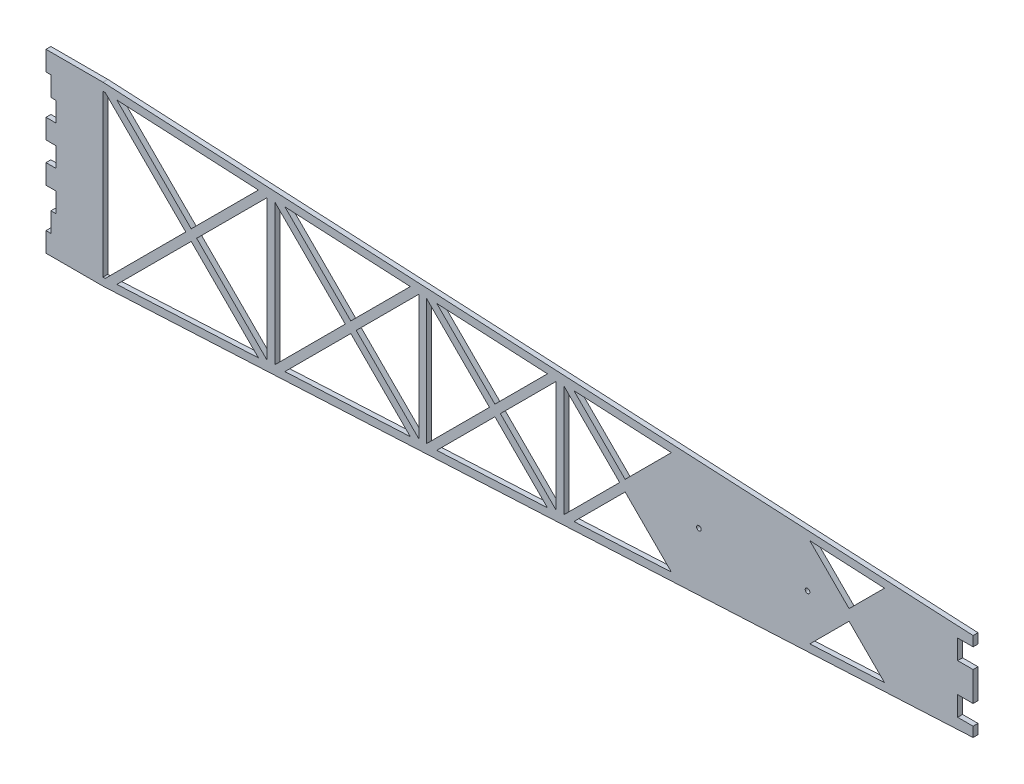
ISO-10303-21;
HEADER;
FILE_DESCRIPTION(('STEP AP214'),'2;1');
FILE_NAME('part.step','',(''),(''),'','','');
FILE_SCHEMA(('AUTOMOTIVE_DESIGN { 1 0 10303 214 1 1 1 1 }'));
ENDSEC;
DATA;
#1=APPLICATION_CONTEXT('core data for automotive mechanical design processes');
#2=APPLICATION_PROTOCOL_DEFINITION('international standard','automotive_design',2000,#1);
#3=PRODUCT_CONTEXT('',#1,'mechanical');
#4=PRODUCT('Part','Part','',(#3));
#5=PRODUCT_RELATED_PRODUCT_CATEGORY('part','',(#4));
#6=PRODUCT_DEFINITION_FORMATION('','',#4);
#7=PRODUCT_DEFINITION_CONTEXT('part definition',#1,'design');
#8=PRODUCT_DEFINITION('design','',#6,#7);
#9=PRODUCT_DEFINITION_SHAPE('','',#8);
#10=(LENGTH_UNIT() NAMED_UNIT(*) SI_UNIT(.MILLI.,.METRE.));
#11=(NAMED_UNIT(*) PLANE_ANGLE_UNIT() SI_UNIT($,.RADIAN.));
#12=(NAMED_UNIT(*) SI_UNIT($,.STERADIAN.) SOLID_ANGLE_UNIT());
#13=UNCERTAINTY_MEASURE_WITH_UNIT(LENGTH_MEASURE(1.E-05),#10,'distance_accuracy_value','');
#14=(GEOMETRIC_REPRESENTATION_CONTEXT(3) GLOBAL_UNCERTAINTY_ASSIGNED_CONTEXT((#13)) GLOBAL_UNIT_ASSIGNED_CONTEXT((#10,
#11,#12)) REPRESENTATION_CONTEXT('',''));
#15=CARTESIAN_POINT('',(0.,0.,0.));
#16=DIRECTION('',(0.,0.,1.));
#17=DIRECTION('',(1.,0.,0.));
#18=AXIS2_PLACEMENT_3D('',#15,#16,#17);
#19=CARTESIAN_POINT('',(0.,0.,-3.175));
#20=DIRECTION('',(0.,0.,1.));
#21=DIRECTION('',(1.,0.,0.));
#22=AXIS2_PLACEMENT_3D('',#19,#20,#21);
#23=PLANE('',#22);
#24=CARTESIAN_POINT('',(422.53,57.15,-3.175));
#25=DIRECTION('',(0.,0.,1.));
#26=DIRECTION('',(1.,0.,0.));
#27=AXIS2_PLACEMENT_3D('',#24,#25,#26);
#28=CIRCLE('',#27,1.50000000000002);
#29=CARTESIAN_POINT('',(424.03,57.15,-3.175));
#30=VERTEX_POINT('',#29);
#31=EDGE_CURVE('E1129',#30,#30,#28,.T.);
#32=ORIENTED_EDGE('',*,*,#31,.T.);
#33=EDGE_LOOP('',(#32));
#34=FACE_BOUND('',#33,.T.);
#35=CARTESIAN_POINT('',(492.8318717,57.15,-3.175));
#36=DIRECTION('',(0.,0.,1.));
#37=DIRECTION('',(1.,0.,0.));
#38=AXIS2_PLACEMENT_3D('',#35,#36,#37);
#39=CIRCLE('',#38,1.49999999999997);
#40=CARTESIAN_POINT('',(494.3318717,57.15,-3.175));
#41=VERTEX_POINT('',#40);
#42=EDGE_CURVE('E1122',#41,#41,#39,.T.);
#43=ORIENTED_EDGE('',*,*,#42,.T.);
#44=EDGE_LOOP('',(#43));
#45=FACE_BOUND('',#44,.T.);
#46=DIRECTION('',(0.707106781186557,0.707106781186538,0.));
#47=VECTOR('',#46,1.);
#48=CARTESIAN_POINT('',(71.8132906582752,-71.8132906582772,-3.175));
#49=LINE('',#48,#47);
#50=CARTESIAN_POINT('',(154.609072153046,10.9824908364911,-3.175));
#51=VERTEX_POINT('',#50);
#52=CARTESIAN_POINT('',(197.241047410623,53.6144660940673,-3.175));
#53=VERTEX_POINT('',#52);
#54=EDGE_CURVE('E1344',#51,#53,#49,.T.);
#55=ORIENTED_EDGE('',*,*,#54,.F.);
#56=DIRECTION('',(0.998715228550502,0.0506743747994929,0.));
#57=VECTOR('',#56,1.);
#58=CARTESIAN_POINT('',(-0.158796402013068,3.12963673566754,-3.175));
#59=LINE('',#58,#57);
#60=CARTESIAN_POINT('',(235.755679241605,15.0998342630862,-3.175));
#61=VERTEX_POINT('',#60);
#62=EDGE_CURVE('E1346',#51,#61,#59,.T.);
#63=ORIENTED_EDGE('',*,*,#62,.T.);
#64=DIRECTION('',(0.707106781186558,-0.707106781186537,0.));
#65=VECTOR('',#64,1.);
#66=CARTESIAN_POINT('',(125.427756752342,125.427756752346,-3.175));
#67=LINE('',#66,#65);
#68=EDGE_CURVE('E1350',#53,#61,#67,.T.);
#69=ORIENTED_EDGE('',*,*,#68,.F.);
#70=EDGE_LOOP('',(#55,#63,#69));
#71=FACE_BOUND('',#70,.T.);
#72=DIRECTION('',(0.998715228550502,-0.0506743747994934,0.));
#73=VECTOR('',#72,1.);
#74=CARTESIAN_POINT('',(5.62584313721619,110.876853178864,-3.175));
#75=LINE('',#74,#73);
#76=CARTESIAN_POINT('',(154.609072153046,103.317509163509,-3.175));
#77=VERTEX_POINT('',#76);
#78=CARTESIAN_POINT('',(235.755679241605,99.2001657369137,-3.175));
#79=VERTEX_POINT('',#78);
#80=EDGE_CURVE('E1367',#77,#79,#75,.T.);
#81=ORIENTED_EDGE('',*,*,#80,.F.);
#82=DIRECTION('',(0.707106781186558,-0.707106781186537,0.));
#83=VECTOR('',#82,1.);
#84=CARTESIAN_POINT('',(128.963290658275,128.963290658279,-3.175));
#85=LINE('',#84,#83);
#86=CARTESIAN_POINT('',(197.241047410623,60.6855339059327,-3.175));
#87=VERTEX_POINT('',#86);
#88=EDGE_CURVE('E1325',#77,#87,#85,.T.);
#89=ORIENTED_EDGE('',*,*,#88,.T.);
#90=DIRECTION('',(0.707106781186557,0.707106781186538,0.));
#91=VECTOR('',#90,1.);
#92=CARTESIAN_POINT('',(68.2777567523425,-68.2777567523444,-3.175));
#93=LINE('',#92,#91);
#94=EDGE_CURVE('E1364',#87,#79,#93,.T.);
#95=ORIENTED_EDGE('',*,*,#94,.T.);
#96=EDGE_LOOP('',(#81,#89,#95));
#97=FACE_BOUND('',#96,.T.);
#98=DIRECTION('',(0.707106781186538,-0.707106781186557,0.));
#99=VECTOR('',#98,1.);
#100=CARTESIAN_POINT('',(172.071868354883,172.071868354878,-3.175));
#101=LINE('',#100,#99);
#102=CARTESIAN_POINT('',(246.385159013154,97.7585776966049,-3.175));
#103=VERTEX_POINT('',#102);
#104=CARTESIAN_POINT('',(286.993736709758,57.15,-3.175));
#105=VERTEX_POINT('',#104);
#106=EDGE_CURVE('E1294',#103,#105,#101,.T.);
#107=ORIENTED_EDGE('',*,*,#106,.F.);
#108=DIRECTION('',(0.,-1.,0.));
#109=VECTOR('',#108,1.);
#110=CARTESIAN_POINT('',(246.385159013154,0.,-3.175));
#111=LINE('',#110,#109);
#112=CARTESIAN_POINT('',(246.385159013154,16.5414223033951,-3.175));
#113=VERTEX_POINT('',#112);
#114=EDGE_CURVE('E1331',#103,#113,#111,.T.);
#115=ORIENTED_EDGE('',*,*,#114,.T.);
#116=DIRECTION('',(0.707106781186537,0.707106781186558,0.));
#117=VECTOR('',#116,1.);
#118=CARTESIAN_POINT('',(114.921868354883,-114.92186835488,-3.175));
#119=LINE('',#118,#117);
#120=EDGE_CURVE('E1334',#113,#105,#119,.T.);
#121=ORIENTED_EDGE('',*,*,#120,.T.);
#122=EDGE_LOOP('',(#107,#115,#121));
#123=FACE_BOUND('',#122,.T.);
#124=DIRECTION('',(0.998715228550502,-0.0506743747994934,0.));
#125=VECTOR('',#124,1.);
#126=CARTESIAN_POINT('',(5.62584313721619,110.876853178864,-3.175));
#127=LINE('',#126,#125);
#128=CARTESIAN_POINT('',(45.828548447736,108.836985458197,-3.175));
#129=VERTEX_POINT('',#128);
#130=CARTESIAN_POINT('',(137.481043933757,104.186577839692,-3.175));
#131=VERTEX_POINT('',#130);
#132=EDGE_CURVE('E1416',#129,#131,#127,.T.);
#133=ORIENTED_EDGE('',*,*,#132,.F.);
#134=DIRECTION('',(0.707106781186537,-0.707106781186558,0.));
#135=VECTOR('',#134,1.);
#136=CARTESIAN_POINT('',(77.3327669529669,77.3327669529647,-3.175));
#137=LINE('',#136,#135);
#138=CARTESIAN_POINT('',(93.9799999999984,60.6855339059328,-3.175));
#139=VERTEX_POINT('',#138);
#140=EDGE_CURVE('E1409',#129,#139,#137,.T.);
#141=ORIENTED_EDGE('',*,*,#140,.T.);
#142=DIRECTION('',(0.707106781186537,0.707106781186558,0.));
#143=VECTOR('',#142,1.);
#144=CARTESIAN_POINT('',(16.6472330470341,-16.6472330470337,-3.175));
#145=LINE('',#144,#143);
#146=EDGE_CURVE('E1412',#139,#131,#145,.T.);
#147=ORIENTED_EDGE('',*,*,#146,.T.);
#148=EDGE_LOOP('',(#133,#141,#147));
#149=FACE_BOUND('',#148,.T.);
#150=DIRECTION('',(0.707106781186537,0.707106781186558,0.));
#151=VECTOR('',#150,1.);
#152=CARTESIAN_POINT('',(20.1827669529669,-20.1827669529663,-3.175));
#153=LINE('',#152,#151);
#154=CARTESIAN_POINT('',(97.5155339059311,57.15,-3.175));
#155=VERTEX_POINT('',#154);
#156=CARTESIAN_POINT('',(143.110523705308,102.744989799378,-3.175));
#157=VERTEX_POINT('',#156);
#158=EDGE_CURVE('E1377',#155,#157,#153,.T.);
#159=ORIENTED_EDGE('',*,*,#158,.F.);
#160=DIRECTION('',(0.707106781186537,-0.707106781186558,0.));
#161=VECTOR('',#160,1.);
#162=CARTESIAN_POINT('',(77.3327669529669,77.3327669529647,-3.175));
#163=LINE('',#162,#161);
#164=CARTESIAN_POINT('',(143.110523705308,11.5550102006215,-3.175));
#165=VERTEX_POINT('',#164);
#166=EDGE_CURVE('E1379',#155,#165,#163,.T.);
#167=ORIENTED_EDGE('',*,*,#166,.T.);
#168=DIRECTION('',(0.,1.,0.));
#169=VECTOR('',#168,1.);
#170=CARTESIAN_POINT('',(143.110523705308,0.,-3.175));
#171=LINE('',#170,#169);
#172=EDGE_CURVE('E1383',#165,#157,#171,.T.);
#173=ORIENTED_EDGE('',*,*,#172,.T.);
#174=EDGE_LOOP('',(#159,#167,#173));
#175=FACE_BOUND('',#174,.T.);
#176=DIRECTION('',(0.707106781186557,0.707106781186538,0.));
#177=VECTOR('',#176,1.);
#178=CARTESIAN_POINT('',(233.059018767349,-233.059018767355,-3.175));
#179=LINE('',#178,#177);
#180=CARTESIAN_POINT('',(494.338237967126,28.2202004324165,-3.175));
#181=VERTEX_POINT('',#180);
#182=CARTESIAN_POINT('',(519.732503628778,53.6144660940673,-3.175));
#183=VERTEX_POINT('',#182);
#184=EDGE_CURVE('E1180',#181,#183,#179,.T.);
#185=ORIENTED_EDGE('',*,*,#184,.F.);
#186=DIRECTION('',(0.998715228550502,0.0506743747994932,0.));
#187=VECTOR('',#186,1.);
#188=CARTESIAN_POINT('',(-0.158796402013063,3.12963673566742,-3.175));
#189=LINE('',#188,#187);
#190=CARTESIAN_POINT('',(542.674222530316,30.67274719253,-3.175));
#191=VERTEX_POINT('',#190);
#192=EDGE_CURVE('E1234',#181,#191,#189,.T.);
#193=ORIENTED_EDGE('',*,*,#192,.T.);
#194=DIRECTION('',(0.707106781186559,-0.707106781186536,0.));
#195=VECTOR('',#194,1.);
#196=CARTESIAN_POINT('',(286.673484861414,286.673484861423,-3.175));
#197=LINE('',#196,#195);
#198=EDGE_CURVE('E1237',#183,#191,#197,.T.);
#199=ORIENTED_EDGE('',*,*,#198,.F.);
#200=EDGE_LOOP('',(#185,#193,#199));
#201=FACE_BOUND('',#200,.T.);
#202=DIRECTION('',(0.998715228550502,-0.0506743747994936,0.));
#203=VECTOR('',#202,1.);
#204=CARTESIAN_POINT('',(5.62584313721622,110.876853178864,-3.175));
#205=LINE('',#204,#203);
#206=CARTESIAN_POINT('',(494.338237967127,86.0797995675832,-3.175));
#207=VERTEX_POINT('',#206);
#208=CARTESIAN_POINT('',(542.674222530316,83.6272528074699,-3.175));
#209=VERTEX_POINT('',#208);
#210=EDGE_CURVE('E1223',#207,#209,#205,.T.);
#211=ORIENTED_EDGE('',*,*,#210,.F.);
#212=DIRECTION('',(0.707106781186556,-0.707106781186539,0.));
#213=VECTOR('',#212,1.);
#214=CARTESIAN_POINT('',(290.209018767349,290.209018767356,-3.175));
#215=LINE('',#214,#213);
#216=CARTESIAN_POINT('',(519.732503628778,60.6855339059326,-3.175));
#217=VERTEX_POINT('',#216);
#218=EDGE_CURVE('E1216',#207,#217,#215,.T.);
#219=ORIENTED_EDGE('',*,*,#218,.T.);
#220=DIRECTION('',(0.707106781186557,0.707106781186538,0.));
#221=VECTOR('',#220,1.);
#222=CARTESIAN_POINT('',(229.523484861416,-229.523484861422,-3.175));
#223=LINE('',#222,#221);
#224=EDGE_CURVE('E1219',#217,#209,#223,.T.);
#225=ORIENTED_EDGE('',*,*,#224,.T.);
#226=EDGE_LOOP('',(#211,#219,#225));
#227=FACE_BOUND('',#226,.T.);
#228=DIRECTION('',(0.707106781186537,0.707106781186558,0.));
#229=VECTOR('',#228,1.);
#230=CARTESIAN_POINT('',(118.457402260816,-118.457402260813,-3.175));
#231=LINE('',#230,#229);
#232=CARTESIAN_POINT('',(252.883707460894,15.9689029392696,-3.175));
#233=VERTEX_POINT('',#232);
#234=CARTESIAN_POINT('',(290.529270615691,53.6144660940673,-3.175));
#235=VERTEX_POINT('',#234);
#236=EDGE_CURVE('E1260',#233,#235,#231,.T.);
#237=ORIENTED_EDGE('',*,*,#236,.F.);
#238=DIRECTION('',(0.998715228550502,0.0506743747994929,0.));
#239=VECTOR('',#238,1.);
#240=CARTESIAN_POINT('',(-0.158796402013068,3.12963673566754,-3.175));
#241=LINE('',#240,#239);
#242=CARTESIAN_POINT('',(324.539071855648,19.6046648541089,-3.175));
#243=VERTEX_POINT('',#242);
#244=EDGE_CURVE('E1300',#233,#243,#241,.T.);
#245=ORIENTED_EDGE('',*,*,#244,.T.);
#246=DIRECTION('',(0.707106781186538,-0.707106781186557,0.));
#247=VECTOR('',#246,1.);
#248=CARTESIAN_POINT('',(172.071868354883,172.071868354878,-3.175));
#249=LINE('',#248,#247);
#250=EDGE_CURVE('E1303',#235,#243,#249,.T.);
#251=ORIENTED_EDGE('',*,*,#250,.F.);
#252=EDGE_LOOP('',(#237,#245,#251));
#253=FACE_BOUND('',#252,.T.);
#254=DIRECTION('',(0.998715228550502,-0.0506743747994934,0.));
#255=VECTOR('',#254,1.);
#256=CARTESIAN_POINT('',(5.62584313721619,110.876853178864,-3.175));
#257=LINE('',#256,#255);
#258=CARTESIAN_POINT('',(36.83,109.293567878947,-3.175));
#259=VERTEX_POINT('',#258);
#260=CARTESIAN_POINT('',(38.3795201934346,109.214945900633,-3.175));
#261=VERTEX_POINT('',#260);
#262=EDGE_CURVE('E1423',#259,#261,#257,.T.);
#263=ORIENTED_EDGE('',*,*,#262,.F.);
#264=DIRECTION('',(0.,-1.,0.));
#265=VECTOR('',#264,1.);
#266=CARTESIAN_POINT('',(36.83,0.,-3.175));
#267=LINE('',#266,#265);
#268=CARTESIAN_POINT('',(36.83,5.00643212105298,-3.175));
#269=VERTEX_POINT('',#268);
#270=EDGE_CURVE('E1443',#259,#269,#267,.T.);
#271=ORIENTED_EDGE('',*,*,#270,.T.);
#272=DIRECTION('',(0.998715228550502,0.0506743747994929,0.));
#273=VECTOR('',#272,1.);
#274=CARTESIAN_POINT('',(-0.158796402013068,3.12963673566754,-3.175));
#275=LINE('',#274,#273);
#276=CARTESIAN_POINT('',(38.3795201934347,5.08505409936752,-3.175));
#277=VERTEX_POINT('',#276);
#278=EDGE_CURVE('E1446',#269,#277,#275,.T.);
#279=ORIENTED_EDGE('',*,*,#278,.T.);
#280=DIRECTION('',(0.707106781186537,0.707106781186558,0.));
#281=VECTOR('',#280,1.);
#282=CARTESIAN_POINT('',(16.6472330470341,-16.6472330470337,-3.175));
#283=LINE('',#282,#281);
#284=CARTESIAN_POINT('',(90.4444660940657,57.15,-3.175));
#285=VERTEX_POINT('',#284);
#286=EDGE_CURVE('E1449',#277,#285,#283,.T.);
#287=ORIENTED_EDGE('',*,*,#286,.T.);
#288=DIRECTION('',(0.707106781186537,-0.707106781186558,0.));
#289=VECTOR('',#288,1.);
#290=CARTESIAN_POINT('',(73.7972330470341,73.797233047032,-3.175));
#291=LINE('',#290,#289);
#292=EDGE_CURVE('E1452',#261,#285,#291,.T.);
#293=ORIENTED_EDGE('',*,*,#292,.F.);
#294=EDGE_LOOP('',(#263,#271,#279,#287,#293));
#295=FACE_BOUND('',#294,.T.);
#296=DIRECTION('',(0.707106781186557,-0.707106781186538,0.));
#297=VECTOR('',#296,1.);
#298=CARTESIAN_POINT('',(214.211149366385,214.211149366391,-3.175));
#299=LINE('',#298,#297);
#300=CARTESIAN_POINT('',(335.1685516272,93.2537471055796,-3.175));
#301=VERTEX_POINT('',#300);
#302=CARTESIAN_POINT('',(371.27229873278,57.1499999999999,-3.175));
#303=VERTEX_POINT('',#302);
#304=EDGE_CURVE('E1270',#301,#303,#299,.T.);
#305=ORIENTED_EDGE('',*,*,#304,.F.);
#306=DIRECTION('',(0.,-1.,0.));
#307=VECTOR('',#306,1.);
#308=CARTESIAN_POINT('',(335.1685516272,0.,-3.175));
#309=LINE('',#308,#307);
#310=CARTESIAN_POINT('',(335.1685516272,21.0462528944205,-3.175));
#311=VERTEX_POINT('',#310);
#312=EDGE_CURVE('E1195',#301,#311,#309,.T.);
#313=ORIENTED_EDGE('',*,*,#312,.T.);
#314=DIRECTION('',(0.707106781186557,0.707106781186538,0.));
#315=VECTOR('',#314,1.);
#316=CARTESIAN_POINT('',(157.061149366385,-157.061149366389,-3.175));
#317=LINE('',#316,#315);
#318=EDGE_CURVE('E1267',#311,#303,#317,.T.);
#319=ORIENTED_EDGE('',*,*,#318,.T.);
#320=EDGE_LOOP('',(#305,#313,#319));
#321=FACE_BOUND('',#320,.T.);
#322=DIRECTION('',(0.707106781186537,0.707106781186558,0.));
#323=VECTOR('',#322,1.);
#324=CARTESIAN_POINT('',(118.457402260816,-118.457402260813,-3.175));
#325=LINE('',#324,#323);
#326=CARTESIAN_POINT('',(294.064804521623,57.1499999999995,-3.175));
#327=VERTEX_POINT('',#326);
#328=CARTESIAN_POINT('',(330.1685516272,93.2537471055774,-3.175));
#329=VERTEX_POINT('',#328);
#330=EDGE_CURVE('E1247',#327,#329,#325,.T.);
#331=ORIENTED_EDGE('',*,*,#330,.F.);
#332=DIRECTION('',(0.707106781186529,-0.707106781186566,0.));
#333=VECTOR('',#332,1.);
#334=CARTESIAN_POINT('',(175.607402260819,175.60740226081,-3.175));
#335=LINE('',#334,#333);
#336=CARTESIAN_POINT('',(330.1685516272,21.0462528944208,-3.175));
#337=VERTEX_POINT('',#336);
#338=EDGE_CURVE('E1249',#327,#337,#335,.T.);
#339=ORIENTED_EDGE('',*,*,#338,.T.);
#340=DIRECTION('',(0.,-1.,0.));
#341=VECTOR('',#340,1.);
#342=CARTESIAN_POINT('',(330.1685516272,0.,-3.175));
#343=LINE('',#342,#341);
#344=EDGE_CURVE('E1253',#329,#337,#343,.T.);
#345=ORIENTED_EDGE('',*,*,#344,.F.);
#346=EDGE_LOOP('',(#331,#339,#345));
#347=FACE_BOUND('',#346,.T.);
#348=DIRECTION('',(0.998715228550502,-0.0506743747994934,0.));
#349=VECTOR('',#348,1.);
#350=CARTESIAN_POINT('',(5.62584313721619,110.876853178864,-3.175));
#351=LINE('',#350,#349);
#352=CARTESIAN_POINT('',(252.883707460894,98.3310970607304,-3.175));
#353=VERTEX_POINT('',#352);
#354=CARTESIAN_POINT('',(324.539071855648,94.6953351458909,-3.175));
#355=VERTEX_POINT('',#354);
#356=EDGE_CURVE('E1287',#353,#355,#351,.T.);
#357=ORIENTED_EDGE('',*,*,#356,.F.);
#358=DIRECTION('',(0.707106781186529,-0.707106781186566,0.));
#359=VECTOR('',#358,1.);
#360=CARTESIAN_POINT('',(175.607402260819,175.60740226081,-3.175));
#361=LINE('',#360,#359);
#362=CARTESIAN_POINT('',(290.52927061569,60.6855339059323,-3.175));
#363=VERTEX_POINT('',#362);
#364=EDGE_CURVE('E1280',#353,#363,#361,.T.);
#365=ORIENTED_EDGE('',*,*,#364,.T.);
#366=DIRECTION('',(0.707106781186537,0.707106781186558,0.));
#367=VECTOR('',#366,1.);
#368=CARTESIAN_POINT('',(114.921868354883,-114.92186835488,-3.175));
#369=LINE('',#368,#367);
#370=EDGE_CURVE('E1283',#363,#355,#369,.T.);
#371=ORIENTED_EDGE('',*,*,#370,.T.);
#372=EDGE_LOOP('',(#357,#365,#371));
#373=FACE_BOUND('',#372,.T.);
#374=DIRECTION('',(0.998715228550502,-0.0506743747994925,0.));
#375=VECTOR('',#374,1.);
#376=CARTESIAN_POINT('',(5.62584313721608,110.876853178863,-3.175));
#377=LINE('',#376,#375);
#378=CARTESIAN_POINT('',(341.667100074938,93.8262664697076,-3.175));
#379=VERTEX_POINT('',#378);
#380=CARTESIAN_POINT('',(404.747874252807,90.6255755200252,-3.175));
#381=VERTEX_POINT('',#380);
#382=EDGE_CURVE('E1188',#379,#381,#377,.T.);
#383=ORIENTED_EDGE('',*,*,#382,.F.);
#384=DIRECTION('',(0.707106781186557,-0.707106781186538,0.));
#385=VECTOR('',#384,1.);
#386=CARTESIAN_POINT('',(217.746683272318,217.746683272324,-3.175));
#387=LINE('',#386,#385);
#388=CARTESIAN_POINT('',(374.807832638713,60.6855339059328,-3.175));
#389=VERTEX_POINT('',#388);
#390=EDGE_CURVE('E1181',#379,#389,#387,.T.);
#391=ORIENTED_EDGE('',*,*,#390,.T.);
#392=DIRECTION('',(0.707106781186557,0.707106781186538,0.));
#393=VECTOR('',#392,1.);
#394=CARTESIAN_POINT('',(157.061149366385,-157.061149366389,-3.175));
#395=LINE('',#394,#393);
#396=EDGE_CURVE('E1184',#389,#381,#395,.T.);
#397=ORIENTED_EDGE('',*,*,#396,.T.);
#398=EDGE_LOOP('',(#383,#391,#397));
#399=FACE_BOUND('',#398,.T.);
#400=DIRECTION('',(0.707106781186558,0.707106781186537,0.));
#401=VECTOR('',#400,1.);
#402=CARTESIAN_POINT('',(160.596683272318,-160.596683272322,-3.175));
#403=LINE('',#402,#401);
#404=CARTESIAN_POINT('',(341.667100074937,20.4737335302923,-3.175));
#405=VERTEX_POINT('',#404);
#406=CARTESIAN_POINT('',(374.807832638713,53.6144660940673,-3.175));
#407=VERTEX_POINT('',#406);
#408=EDGE_CURVE('E1200',#405,#407,#403,.T.);
#409=ORIENTED_EDGE('',*,*,#408,.F.);
#410=DIRECTION('',(0.998715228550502,0.0506743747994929,0.));
#411=VECTOR('',#410,1.);
#412=CARTESIAN_POINT('',(-0.158796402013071,3.1296367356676,-3.175));
#413=LINE('',#412,#411);
#414=CARTESIAN_POINT('',(404.747874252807,23.6744244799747,-3.175));
#415=VERTEX_POINT('',#414);
#416=EDGE_CURVE('E1202',#405,#415,#413,.T.);
#417=ORIENTED_EDGE('',*,*,#416,.T.);
#418=DIRECTION('',(0.707106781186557,-0.707106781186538,0.));
#419=VECTOR('',#418,1.);
#420=CARTESIAN_POINT('',(214.211149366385,214.211149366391,-3.175));
#421=LINE('',#420,#419);
#422=EDGE_CURVE('E1206',#407,#415,#421,.T.);
#423=ORIENTED_EDGE('',*,*,#422,.F.);
#424=EDGE_LOOP('',(#409,#417,#423));
#425=FACE_BOUND('',#424,.T.);
#426=DIRECTION('',(0.,1.,0.));
#427=VECTOR('',#426,1.);
#428=CARTESIAN_POINT('',(148.110523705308,0.,-3.175));
#429=LINE('',#428,#427);
#430=CARTESIAN_POINT('',(148.110523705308,11.5550102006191,-3.175));
#431=VERTEX_POINT('',#430);
#432=CARTESIAN_POINT('',(148.110523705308,102.744989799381,-3.175));
#433=VERTEX_POINT('',#432);
#434=EDGE_CURVE('E1357',#431,#433,#429,.T.);
#435=ORIENTED_EDGE('',*,*,#434,.F.);
#436=DIRECTION('',(0.707106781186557,0.707106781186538,0.));
#437=VECTOR('',#436,1.);
#438=CARTESIAN_POINT('',(68.2777567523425,-68.2777567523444,-3.175));
#439=LINE('',#438,#437);
#440=CARTESIAN_POINT('',(193.70551350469,57.15,-3.175));
#441=VERTEX_POINT('',#440);
#442=EDGE_CURVE('E1396',#431,#441,#439,.T.);
#443=ORIENTED_EDGE('',*,*,#442,.T.);
#444=DIRECTION('',(0.707106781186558,-0.707106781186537,0.));
#445=VECTOR('',#444,1.);
#446=CARTESIAN_POINT('',(125.427756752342,125.427756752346,-3.175));
#447=LINE('',#446,#445);
#448=EDGE_CURVE('E1399',#433,#441,#447,.T.);
#449=ORIENTED_EDGE('',*,*,#448,.F.);
#450=EDGE_LOOP('',(#435,#443,#449));
#451=FACE_BOUND('',#450,.T.);
#452=DIRECTION('',(0.707106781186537,0.707106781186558,0.));
#453=VECTOR('',#452,1.);
#454=CARTESIAN_POINT('',(20.1827669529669,-20.1827669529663,-3.175));
#455=LINE('',#454,#453);
#456=CARTESIAN_POINT('',(45.828548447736,5.46301454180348,-3.175));
#457=VERTEX_POINT('',#456);
#458=CARTESIAN_POINT('',(93.9799999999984,53.6144660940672,-3.175));
#459=VERTEX_POINT('',#458);
#460=EDGE_CURVE('E1390',#457,#459,#455,.T.);
#461=ORIENTED_EDGE('',*,*,#460,.F.);
#462=DIRECTION('',(0.998715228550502,0.0506743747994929,0.));
#463=VECTOR('',#462,1.);
#464=CARTESIAN_POINT('',(-0.158796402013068,3.12963673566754,-3.175));
#465=LINE('',#464,#463);
#466=CARTESIAN_POINT('',(137.481043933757,10.1134221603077,-3.175));
#467=VERTEX_POINT('',#466);
#468=EDGE_CURVE('E1429',#457,#467,#465,.T.);
#469=ORIENTED_EDGE('',*,*,#468,.T.);
#470=DIRECTION('',(0.707106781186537,-0.707106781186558,0.));
#471=VECTOR('',#470,1.);
#472=CARTESIAN_POINT('',(73.7972330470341,73.797233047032,-3.175));
#473=LINE('',#472,#471);
#474=EDGE_CURVE('E1432',#459,#467,#473,.T.);
#475=ORIENTED_EDGE('',*,*,#474,.F.);
#476=EDGE_LOOP('',(#461,#469,#475));
#477=FACE_BOUND('',#476,.T.);
#478=DIRECTION('',(0.,-1.,0.));
#479=VECTOR('',#478,1.);
#480=CARTESIAN_POINT('',(241.385159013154,0.,-3.175));
#481=LINE('',#480,#479);
#482=CARTESIAN_POINT('',(241.385159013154,97.7585776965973,-3.175));
#483=VERTEX_POINT('',#482);
#484=CARTESIAN_POINT('',(241.385159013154,16.5414223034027,-3.175));
#485=VERTEX_POINT('',#484);
#486=EDGE_CURVE('E1313',#483,#485,#481,.T.);
#487=ORIENTED_EDGE('',*,*,#486,.F.);
#488=DIRECTION('',(0.707106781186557,0.707106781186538,0.));
#489=VECTOR('',#488,1.);
#490=CARTESIAN_POINT('',(71.8132906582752,-71.8132906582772,-3.175));
#491=LINE('',#490,#489);
#492=CARTESIAN_POINT('',(200.776581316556,57.15,-3.175));
#493=VERTEX_POINT('',#492);
#494=EDGE_CURVE('E1315',#493,#483,#491,.T.);
#495=ORIENTED_EDGE('',*,*,#494,.F.);
#496=DIRECTION('',(0.707106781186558,-0.707106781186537,0.));
#497=VECTOR('',#496,1.);
#498=CARTESIAN_POINT('',(128.963290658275,128.963290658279,-3.175));
#499=LINE('',#498,#497);
#500=EDGE_CURVE('E1318',#493,#485,#499,.T.);
#501=ORIENTED_EDGE('',*,*,#500,.T.);
#502=EDGE_LOOP('',(#487,#495,#501));
#503=FACE_BOUND('',#502,.T.);
#504=DIRECTION('',(0.,1.,0.));
#505=VECTOR('',#504,1.);
#506=CARTESIAN_POINT('',(6.590050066,88.9,-3.175));
#507=LINE('',#506,#505);
#508=CARTESIAN_POINT('',(6.590050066,76.2,-3.175));
#509=VERTEX_POINT('',#508);
#510=CARTESIAN_POINT('',(6.590050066,88.9,-3.175));
#511=VERTEX_POINT('',#510);
#512=EDGE_CURVE('E1095',#509,#511,#507,.T.);
#513=ORIENTED_EDGE('',*,*,#512,.T.);
#514=DIRECTION('',(1.,0.,0.));
#515=VECTOR('',#514,1.);
#516=CARTESIAN_POINT('',(0.,88.9,-3.175));
#517=LINE('',#516,#515);
#518=CARTESIAN_POINT('',(3.175,88.9,-3.175));
#519=VERTEX_POINT('',#518);
#520=EDGE_CURVE('E1102',#519,#511,#517,.T.);
#521=ORIENTED_EDGE('',*,*,#520,.F.);
#522=DIRECTION('',(0.,-1.,0.));
#523=VECTOR('',#522,1.);
#524=CARTESIAN_POINT('',(3.175,0.,-3.175));
#525=LINE('',#524,#523);
#526=CARTESIAN_POINT('',(3.175,101.6,-3.175));
#527=VERTEX_POINT('',#526);
#528=EDGE_CURVE('E1507',#527,#519,#525,.T.);
#529=ORIENTED_EDGE('',*,*,#528,.F.);
#530=DIRECTION('',(1.,0.,0.));
#531=VECTOR('',#530,1.);
#532=CARTESIAN_POINT('',(0.,101.6,-3.175));
#533=LINE('',#532,#531);
#534=CARTESIAN_POINT('',(0.,101.6,-3.175));
#535=VERTEX_POINT('',#534);
#536=EDGE_CURVE('E1504',#535,#527,#533,.T.);
#537=ORIENTED_EDGE('',*,*,#536,.F.);
#538=DIRECTION('',(0.,1.,0.));
#539=VECTOR('',#538,1.);
#540=CARTESIAN_POINT('',(0.,0.,-3.175));
#541=LINE('',#540,#539);
#542=CARTESIAN_POINT('',(0.,114.3,-3.175));
#543=VERTEX_POINT('',#542);
#544=EDGE_CURVE('E1471',#535,#543,#541,.T.);
#545=ORIENTED_EDGE('',*,*,#544,.T.);
#546=DIRECTION('',(1.,0.,0.));
#547=VECTOR('',#546,1.);
#548=CARTESIAN_POINT('',(0.,114.3,-3.175));
#549=LINE('',#548,#547);
#550=CARTESIAN_POINT('',(36.83,114.3,-3.175));
#551=VERTEX_POINT('',#550);
#552=EDGE_CURVE('E1502',#543,#551,#549,.T.);
#553=ORIENTED_EDGE('',*,*,#552,.T.);
#554=DIRECTION('',(0.998715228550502,-0.0506743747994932,0.));
#555=VECTOR('',#554,1.);
#556=CARTESIAN_POINT('',(5.87921501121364,115.870429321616,-3.175));
#557=LINE('',#556,#555);
#558=CARTESIAN_POINT('',(600.,85.725,-3.175));
#559=VERTEX_POINT('',#558);
#560=EDGE_CURVE('E1498',#551,#559,#557,.T.);
#561=ORIENTED_EDGE('',*,*,#560,.T.);
#562=DIRECTION('',(0.,1.,0.));
#563=VECTOR('',#562,1.);
#564=CARTESIAN_POINT('',(600.,0.,-3.175));
#565=LINE('',#564,#563);
#566=CARTESIAN_POINT('',(600.,79.375,-3.175));
#567=VERTEX_POINT('',#566);
#568=EDGE_CURVE('E1494',#567,#559,#565,.T.);
#569=ORIENTED_EDGE('',*,*,#568,.F.);
#570=DIRECTION('',(1.,0.,0.));
#571=VECTOR('',#570,1.);
#572=CARTESIAN_POINT('',(0.,79.375,-3.175));
#573=LINE('',#572,#571);
#574=CARTESIAN_POINT('',(590.,79.375,-3.175));
#575=VERTEX_POINT('',#574);
#576=EDGE_CURVE('E590',#575,#567,#573,.T.);
#577=ORIENTED_EDGE('',*,*,#576,.F.);
#578=DIRECTION('',(0.,1.,0.));
#579=VECTOR('',#578,1.);
#580=CARTESIAN_POINT('',(590.,0.,-3.175));
#581=LINE('',#580,#579);
#582=CARTESIAN_POINT('',(590.,66.675,-3.175));
#583=VERTEX_POINT('',#582);
#584=EDGE_CURVE('E1139',#583,#575,#581,.T.);
#585=ORIENTED_EDGE('',*,*,#584,.F.);
#586=DIRECTION('',(-1.,0.,0.));
#587=VECTOR('',#586,1.);
#588=CARTESIAN_POINT('',(0.,66.675,-3.175));
#589=LINE('',#588,#587);
#590=CARTESIAN_POINT('',(600.,66.675,-3.175));
#591=VERTEX_POINT('',#590);
#592=EDGE_CURVE('E1135',#591,#583,#589,.T.);
#593=ORIENTED_EDGE('',*,*,#592,.F.);
#594=CARTESIAN_POINT('',(600.,47.625,-3.175));
#595=VERTEX_POINT('',#594);
#596=EDGE_CURVE('E1499',#595,#591,#565,.T.);
#597=ORIENTED_EDGE('',*,*,#596,.F.);
#598=DIRECTION('',(-1.,0.,0.));
#599=VECTOR('',#598,1.);
#600=CARTESIAN_POINT('',(0.,47.6249999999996,-3.175));
#601=LINE('',#600,#599);
#602=CARTESIAN_POINT('',(590.,47.625,-3.175));
#603=VERTEX_POINT('',#602);
#604=EDGE_CURVE('E598',#595,#603,#601,.T.);
#605=ORIENTED_EDGE('',*,*,#604,.T.);
#606=DIRECTION('',(0.,-1.,0.));
#607=VECTOR('',#606,1.);
#608=CARTESIAN_POINT('',(590.,0.,-3.175));
#609=LINE('',#608,#607);
#610=CARTESIAN_POINT('',(590.,34.925,-3.175));
#611=VERTEX_POINT('',#610);
#612=EDGE_CURVE('E1158',#603,#611,#609,.T.);
#613=ORIENTED_EDGE('',*,*,#612,.T.);
#614=DIRECTION('',(1.,0.,0.));
#615=VECTOR('',#614,1.);
#616=CARTESIAN_POINT('',(0.,34.925,-3.175));
#617=LINE('',#616,#615);
#618=CARTESIAN_POINT('',(600.,34.925,-3.175));
#619=VERTEX_POINT('',#618);
#620=EDGE_CURVE('E1153',#611,#619,#617,.T.);
#621=ORIENTED_EDGE('',*,*,#620,.T.);
#622=CARTESIAN_POINT('',(600.,28.575,-3.175));
#623=VERTEX_POINT('',#622);
#624=EDGE_CURVE('E1495',#623,#619,#565,.T.);
#625=ORIENTED_EDGE('',*,*,#624,.F.);
#626=DIRECTION('',(0.998715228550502,0.0506743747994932,0.));
#627=VECTOR('',#626,1.);
#628=CARTESIAN_POINT('',(0.0945754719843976,-1.86393940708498,-3.175));
#629=LINE('',#628,#627);
#630=CARTESIAN_POINT('',(36.83,0.,-3.175));
#631=VERTEX_POINT('',#630);
#632=EDGE_CURVE('E1491',#631,#623,#629,.T.);
#633=ORIENTED_EDGE('',*,*,#632,.F.);
#634=DIRECTION('',(1.,0.,0.));
#635=VECTOR('',#634,1.);
#636=CARTESIAN_POINT('',(0.,0.,-3.175));
#637=LINE('',#636,#635);
#638=CARTESIAN_POINT('',(0.,0.,-3.175));
#639=VERTEX_POINT('',#638);
#640=EDGE_CURVE('E1488',#639,#631,#637,.T.);
#641=ORIENTED_EDGE('',*,*,#640,.F.);
#642=CARTESIAN_POINT('',(0.,12.7,-3.175));
#643=VERTEX_POINT('',#642);
#644=EDGE_CURVE('E1487',#639,#643,#541,.T.);
#645=ORIENTED_EDGE('',*,*,#644,.T.);
#646=DIRECTION('',(1.,0.,0.));
#647=VECTOR('',#646,1.);
#648=CARTESIAN_POINT('',(0.,12.7,-3.175));
#649=LINE('',#648,#647);
#650=CARTESIAN_POINT('',(3.175,12.7,-3.175));
#651=VERTEX_POINT('',#650);
#652=EDGE_CURVE('E1485',#643,#651,#649,.T.);
#653=ORIENTED_EDGE('',*,*,#652,.T.);
#654=DIRECTION('',(0.,1.,0.));
#655=VECTOR('',#654,1.);
#656=CARTESIAN_POINT('',(3.175,0.,-3.175));
#657=LINE('',#656,#655);
#658=CARTESIAN_POINT('',(3.175,25.4,-3.175));
#659=VERTEX_POINT('',#658);
#660=EDGE_CURVE('E1483',#651,#659,#657,.T.);
#661=ORIENTED_EDGE('',*,*,#660,.T.);
#662=DIRECTION('',(1.,0.,0.));
#663=VECTOR('',#662,1.);
#664=CARTESIAN_POINT('',(0.,25.4,-3.175));
#665=LINE('',#664,#663);
#666=CARTESIAN_POINT('',(6.590050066,25.4,-3.175));
#667=VERTEX_POINT('',#666);
#668=EDGE_CURVE('E1481',#659,#667,#665,.T.);
#669=ORIENTED_EDGE('',*,*,#668,.T.);
#670=DIRECTION('',(0.,1.,0.));
#671=VECTOR('',#670,1.);
#672=CARTESIAN_POINT('',(6.590050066,38.1,-3.175));
#673=LINE('',#672,#671);
#674=CARTESIAN_POINT('',(6.590050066,38.1,-3.175));
#675=VERTEX_POINT('',#674);
#676=EDGE_CURVE('E1116',#667,#675,#673,.T.);
#677=ORIENTED_EDGE('',*,*,#676,.T.);
#678=DIRECTION('',(-1.,0.,0.));
#679=VECTOR('',#678,1.);
#680=CARTESIAN_POINT('',(0.,38.1,-3.175));
#681=LINE('',#680,#679);
#682=CARTESIAN_POINT('',(0.,38.1,-3.175));
#683=VERTEX_POINT('',#682);
#684=EDGE_CURVE('E1479',#675,#683,#681,.T.);
#685=ORIENTED_EDGE('',*,*,#684,.T.);
#686=CARTESIAN_POINT('',(0.,50.8,-3.175));
#687=VERTEX_POINT('',#686);
#688=EDGE_CURVE('E1472',#683,#687,#541,.T.);
#689=ORIENTED_EDGE('',*,*,#688,.T.);
#690=DIRECTION('',(1.,0.,0.));
#691=VECTOR('',#690,1.);
#692=CARTESIAN_POINT('',(0.,50.8,-3.175));
#693=LINE('',#692,#691);
#694=CARTESIAN_POINT('',(6.590050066,50.8,-3.175));
#695=VERTEX_POINT('',#694);
#696=EDGE_CURVE('E1477',#687,#695,#693,.T.);
#697=ORIENTED_EDGE('',*,*,#696,.T.);
#698=DIRECTION('',(0.,1.,0.));
#699=VECTOR('',#698,1.);
#700=CARTESIAN_POINT('',(6.590050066,0.,-3.175));
#701=LINE('',#700,#699);
#702=CARTESIAN_POINT('',(6.590050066,63.5,-3.175));
#703=VERTEX_POINT('',#702);
#704=EDGE_CURVE('E1475',#695,#703,#701,.T.);
#705=ORIENTED_EDGE('',*,*,#704,.T.);
#706=DIRECTION('',(1.,0.,0.));
#707=VECTOR('',#706,1.);
#708=CARTESIAN_POINT('',(0.,63.5,-3.175));
#709=LINE('',#708,#707);
#710=CARTESIAN_POINT('',(0.,63.5,-3.175));
#711=VERTEX_POINT('',#710);
#712=EDGE_CURVE('E1470',#711,#703,#709,.T.);
#713=ORIENTED_EDGE('',*,*,#712,.F.);
#714=CARTESIAN_POINT('',(0.,76.2,-3.175));
#715=VERTEX_POINT('',#714);
#716=EDGE_CURVE('E1098',#711,#715,#541,.T.);
#717=ORIENTED_EDGE('',*,*,#716,.T.);
#718=DIRECTION('',(-1.,0.,0.));
#719=VECTOR('',#718,1.);
#720=CARTESIAN_POINT('',(0.,76.2,-3.175));
#721=LINE('',#720,#719);
#722=EDGE_CURVE('E1091',#509,#715,#721,.T.);
#723=ORIENTED_EDGE('',*,*,#722,.F.);
#724=EDGE_LOOP('',(#513,#521,#529,#537,#545,#553,#561,#569,#577,#585,#593,#597,#605,#613,#621,
#625,#633,#641,#645,#653,#661,#669,#677,#685,#689,#697,#705,#713,#717,#723));
#725=FACE_BOUND('',#724,.T.);
#726=ADVANCED_FACE('F575',(#34,#45,#71,#97,#123,#149,#175,#201,#227,#253,#295,#321,#347,#373,
#399,#425,#451,#477,#503,#725),#23,.F.);
#727=CARTESIAN_POINT('',(0.,0.,0.));
#728=DIRECTION('',(0.,0.,1.));
#729=DIRECTION('',(1.,0.,0.));
#730=AXIS2_PLACEMENT_3D('',#727,#728,#729);
#731=PLANE('',#730);
#732=DIRECTION('',(1.,0.,0.));
#733=VECTOR('',#732,1.);
#734=CARTESIAN_POINT('',(0.,88.9,0.));
#735=LINE('',#734,#733);
#736=CARTESIAN_POINT('',(3.175,88.9,0.));
#737=VERTEX_POINT('',#736);
#738=CARTESIAN_POINT('',(6.590050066,88.9,0.));
#739=VERTEX_POINT('',#738);
#740=EDGE_CURVE('E1554',#737,#739,#735,.T.);
#741=ORIENTED_EDGE('',*,*,#740,.T.);
#742=DIRECTION('',(0.,1.,0.));
#743=VECTOR('',#742,1.);
#744=CARTESIAN_POINT('',(6.59005006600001,0.,0.));
#745=LINE('',#744,#743);
#746=CARTESIAN_POINT('',(6.590050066,76.2,0.));
#747=VERTEX_POINT('',#746);
#748=EDGE_CURVE('E12',#747,#739,#745,.T.);
#749=ORIENTED_EDGE('',*,*,#748,.F.);
#750=DIRECTION('',(-1.,0.,0.));
#751=VECTOR('',#750,1.);
#752=CARTESIAN_POINT('',(0.,76.2,0.));
#753=LINE('',#752,#751);
#754=CARTESIAN_POINT('',(0.,76.2,0.));
#755=VERTEX_POINT('',#754);
#756=EDGE_CURVE('E1108',#747,#755,#753,.T.);
#757=ORIENTED_EDGE('',*,*,#756,.T.);
#758=DIRECTION('',(0.,1.,0.));
#759=VECTOR('',#758,1.);
#760=CARTESIAN_POINT('',(0.,0.,0.));
#761=LINE('',#760,#759);
#762=CARTESIAN_POINT('',(0.,63.5,0.));
#763=VERTEX_POINT('',#762);
#764=EDGE_CURVE('E1458',#763,#755,#761,.T.);
#765=ORIENTED_EDGE('',*,*,#764,.F.);
#766=DIRECTION('',(1.,0.,0.));
#767=VECTOR('',#766,1.);
#768=CARTESIAN_POINT('',(0.,63.5,0.));
#769=LINE('',#768,#767);
#770=CARTESIAN_POINT('',(6.590050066,63.5,0.));
#771=VERTEX_POINT('',#770);
#772=EDGE_CURVE('E1513',#763,#771,#769,.T.);
#773=ORIENTED_EDGE('',*,*,#772,.T.);
#774=DIRECTION('',(0.,1.,0.));
#775=VECTOR('',#774,1.);
#776=CARTESIAN_POINT('',(6.590050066,0.,0.));
#777=LINE('',#776,#775);
#778=CARTESIAN_POINT('',(6.590050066,50.8,0.));
#779=VERTEX_POINT('',#778);
#780=EDGE_CURVE('E1518',#779,#771,#777,.T.);
#781=ORIENTED_EDGE('',*,*,#780,.F.);
#782=DIRECTION('',(1.,0.,0.));
#783=VECTOR('',#782,1.);
#784=CARTESIAN_POINT('',(0.,50.8,0.));
#785=LINE('',#784,#783);
#786=CARTESIAN_POINT('',(0.,50.8,0.));
#787=VERTEX_POINT('',#786);
#788=EDGE_CURVE('E1521',#787,#779,#785,.T.);
#789=ORIENTED_EDGE('',*,*,#788,.F.);
#790=CARTESIAN_POINT('',(0.,38.1,0.));
#791=VERTEX_POINT('',#790);
#792=EDGE_CURVE('E1515',#791,#787,#761,.T.);
#793=ORIENTED_EDGE('',*,*,#792,.F.);
#794=DIRECTION('',(-1.,0.,0.));
#795=VECTOR('',#794,1.);
#796=CARTESIAN_POINT('',(0.,38.1,0.));
#797=LINE('',#796,#795);
#798=CARTESIAN_POINT('',(6.590050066,38.1,0.));
#799=VERTEX_POINT('',#798);
#800=EDGE_CURVE('E1523',#799,#791,#797,.T.);
#801=ORIENTED_EDGE('',*,*,#800,.F.);
#802=DIRECTION('',(0.,1.,0.));
#803=VECTOR('',#802,1.);
#804=CARTESIAN_POINT('',(6.59005006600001,0.,0.));
#805=LINE('',#804,#803);
#806=CARTESIAN_POINT('',(6.590050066,25.4,0.));
#807=VERTEX_POINT('',#806);
#808=EDGE_CURVE('E583',#807,#799,#805,.T.);
#809=ORIENTED_EDGE('',*,*,#808,.F.);
#810=DIRECTION('',(1.,0.,0.));
#811=VECTOR('',#810,1.);
#812=CARTESIAN_POINT('',(0.,25.4,0.));
#813=LINE('',#812,#811);
#814=CARTESIAN_POINT('',(3.175,25.4,0.));
#815=VERTEX_POINT('',#814);
#816=EDGE_CURVE('E1525',#815,#807,#813,.T.);
#817=ORIENTED_EDGE('',*,*,#816,.F.);
#818=DIRECTION('',(0.,1.,0.));
#819=VECTOR('',#818,1.);
#820=CARTESIAN_POINT('',(3.175,0.,0.));
#821=LINE('',#820,#819);
#822=CARTESIAN_POINT('',(3.175,12.7,0.));
#823=VERTEX_POINT('',#822);
#824=EDGE_CURVE('E1527',#823,#815,#821,.T.);
#825=ORIENTED_EDGE('',*,*,#824,.F.);
#826=DIRECTION('',(1.,0.,0.));
#827=VECTOR('',#826,1.);
#828=CARTESIAN_POINT('',(0.,12.7,0.));
#829=LINE('',#828,#827);
#830=CARTESIAN_POINT('',(0.,12.7,0.));
#831=VERTEX_POINT('',#830);
#832=EDGE_CURVE('E1529',#831,#823,#829,.T.);
#833=ORIENTED_EDGE('',*,*,#832,.F.);
#834=CARTESIAN_POINT('',(0.,0.,0.));
#835=VERTEX_POINT('',#834);
#836=EDGE_CURVE('E1531',#835,#831,#761,.T.);
#837=ORIENTED_EDGE('',*,*,#836,.F.);
#838=DIRECTION('',(1.,0.,0.));
#839=VECTOR('',#838,1.);
#840=CARTESIAN_POINT('',(0.,0.,0.));
#841=LINE('',#840,#839);
#842=CARTESIAN_POINT('',(36.83,0.,0.));
#843=VERTEX_POINT('',#842);
#844=EDGE_CURVE('E1532',#835,#843,#841,.T.);
#845=ORIENTED_EDGE('',*,*,#844,.T.);
#846=DIRECTION('',(0.998715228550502,0.0506743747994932,0.));
#847=VECTOR('',#846,1.);
#848=CARTESIAN_POINT('',(0.0945754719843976,-1.86393940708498,0.));
#849=LINE('',#848,#847);
#850=CARTESIAN_POINT('',(600.,28.575,0.));
#851=VERTEX_POINT('',#850);
#852=EDGE_CURVE('E1535',#843,#851,#849,.T.);
#853=ORIENTED_EDGE('',*,*,#852,.T.);
#854=DIRECTION('',(0.,1.,0.));
#855=VECTOR('',#854,1.);
#856=CARTESIAN_POINT('',(600.,0.,0.));
#857=LINE('',#856,#855);
#858=CARTESIAN_POINT('',(600.,34.925,0.));
#859=VERTEX_POINT('',#858);
#860=EDGE_CURVE('E1539',#851,#859,#857,.T.);
#861=ORIENTED_EDGE('',*,*,#860,.T.);
#862=DIRECTION('',(1.,0.,0.));
#863=VECTOR('',#862,1.);
#864=CARTESIAN_POINT('',(0.,34.925,0.));
#865=LINE('',#864,#863);
#866=CARTESIAN_POINT('',(590.,34.925,0.));
#867=VERTEX_POINT('',#866);
#868=EDGE_CURVE('E1172',#867,#859,#865,.T.);
#869=ORIENTED_EDGE('',*,*,#868,.F.);
#870=DIRECTION('',(0.,-1.,0.));
#871=VECTOR('',#870,1.);
#872=CARTESIAN_POINT('',(590.,0.,0.));
#873=LINE('',#872,#871);
#874=CARTESIAN_POINT('',(590.,47.625,0.));
#875=VERTEX_POINT('',#874);
#876=EDGE_CURVE('E1738',#875,#867,#873,.T.);
#877=ORIENTED_EDGE('',*,*,#876,.F.);
#878=DIRECTION('',(-1.,0.,0.));
#879=VECTOR('',#878,1.);
#880=CARTESIAN_POINT('',(0.,47.6249999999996,0.));
#881=LINE('',#880,#879);
#882=CARTESIAN_POINT('',(600.,47.625,0.));
#883=VERTEX_POINT('',#882);
#884=EDGE_CURVE('E1145',#883,#875,#881,.T.);
#885=ORIENTED_EDGE('',*,*,#884,.F.);
#886=CARTESIAN_POINT('',(600.,66.675,0.));
#887=VERTEX_POINT('',#886);
#888=EDGE_CURVE('E1543',#883,#887,#857,.T.);
#889=ORIENTED_EDGE('',*,*,#888,.T.);
#890=DIRECTION('',(-1.,0.,0.));
#891=VECTOR('',#890,1.);
#892=CARTESIAN_POINT('',(0.,66.675,0.));
#893=LINE('',#892,#891);
#894=CARTESIAN_POINT('',(590.,66.675,0.));
#895=VERTEX_POINT('',#894);
#896=EDGE_CURVE('E1177',#887,#895,#893,.T.);
#897=ORIENTED_EDGE('',*,*,#896,.T.);
#898=DIRECTION('',(0.,1.,0.));
#899=VECTOR('',#898,1.);
#900=CARTESIAN_POINT('',(590.,0.,0.));
#901=LINE('',#900,#899);
#902=CARTESIAN_POINT('',(590.,79.375,0.));
#903=VERTEX_POINT('',#902);
#904=EDGE_CURVE('E1741',#895,#903,#901,.T.);
#905=ORIENTED_EDGE('',*,*,#904,.T.);
#906=DIRECTION('',(1.,0.,0.));
#907=VECTOR('',#906,1.);
#908=CARTESIAN_POINT('',(0.,79.375,0.));
#909=LINE('',#908,#907);
#910=CARTESIAN_POINT('',(600.,79.375,0.));
#911=VERTEX_POINT('',#910);
#912=EDGE_CURVE('E1174',#903,#911,#909,.T.);
#913=ORIENTED_EDGE('',*,*,#912,.T.);
#914=CARTESIAN_POINT('',(600.,85.725,0.));
#915=VERTEX_POINT('',#914);
#916=EDGE_CURVE('E1538',#911,#915,#857,.T.);
#917=ORIENTED_EDGE('',*,*,#916,.T.);
#918=DIRECTION('',(0.998715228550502,-0.0506743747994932,0.));
#919=VECTOR('',#918,1.);
#920=CARTESIAN_POINT('',(5.87921501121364,115.870429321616,0.));
#921=LINE('',#920,#919);
#922=CARTESIAN_POINT('',(36.83,114.3,0.));
#923=VERTEX_POINT('',#922);
#924=EDGE_CURVE('E1542',#923,#915,#921,.T.);
#925=ORIENTED_EDGE('',*,*,#924,.F.);
#926=DIRECTION('',(1.,0.,0.));
#927=VECTOR('',#926,1.);
#928=CARTESIAN_POINT('',(0.,114.3,0.));
#929=LINE('',#928,#927);
#930=CARTESIAN_POINT('',(0.,114.3,0.));
#931=VERTEX_POINT('',#930);
#932=EDGE_CURVE('E1546',#931,#923,#929,.T.);
#933=ORIENTED_EDGE('',*,*,#932,.F.);
#934=CARTESIAN_POINT('',(0.,101.6,0.));
#935=VERTEX_POINT('',#934);
#936=EDGE_CURVE('E1514',#935,#931,#761,.T.);
#937=ORIENTED_EDGE('',*,*,#936,.F.);
#938=DIRECTION('',(1.,0.,0.));
#939=VECTOR('',#938,1.);
#940=CARTESIAN_POINT('',(0.,101.6,0.));
#941=LINE('',#940,#939);
#942=CARTESIAN_POINT('',(3.175,101.6,0.));
#943=VERTEX_POINT('',#942);
#944=EDGE_CURVE('E1548',#935,#943,#941,.T.);
#945=ORIENTED_EDGE('',*,*,#944,.T.);
#946=DIRECTION('',(0.,-1.,0.));
#947=VECTOR('',#946,1.);
#948=CARTESIAN_POINT('',(3.175,0.,0.));
#949=LINE('',#948,#947);
#950=EDGE_CURVE('E1551',#943,#737,#949,.T.);
#951=ORIENTED_EDGE('',*,*,#950,.T.);
#952=EDGE_LOOP('',(#741,#749,#757,#765,#773,#781,#789,#793,#801,#809,#817,#825,#833,#837,#845,
#853,#861,#869,#877,#885,#889,#897,#905,#913,#917,#925,#933,#937,#945,#951));
#953=FACE_BOUND('',#952,.T.);
#954=CARTESIAN_POINT('',(422.53,57.15,0.));
#955=DIRECTION('',(0.,0.,1.));
#956=DIRECTION('',(1.,0.,0.));
#957=AXIS2_PLACEMENT_3D('',#954,#955,#956);
#958=CIRCLE('',#957,1.50000000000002);
#959=CARTESIAN_POINT('',(424.03,57.15,0.));
#960=VERTEX_POINT('',#959);
#961=EDGE_CURVE('E1156',#960,#960,#958,.T.);
#962=ORIENTED_EDGE('',*,*,#961,.F.);
#963=EDGE_LOOP('',(#962));
#964=FACE_BOUND('',#963,.T.);
#965=CARTESIAN_POINT('',(492.8318717,57.15,0.));
#966=DIRECTION('',(0.,0.,1.));
#967=DIRECTION('',(1.,0.,0.));
#968=AXIS2_PLACEMENT_3D('',#965,#966,#967);
#969=CIRCLE('',#968,1.49999999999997);
#970=CARTESIAN_POINT('',(494.3318717,57.15,0.));
#971=VERTEX_POINT('',#970);
#972=EDGE_CURVE('E1132',#971,#971,#969,.T.);
#973=ORIENTED_EDGE('',*,*,#972,.F.);
#974=EDGE_LOOP('',(#973));
#975=FACE_BOUND('',#974,.T.);
#976=DIRECTION('',(0.707106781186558,-0.707106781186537,0.));
#977=VECTOR('',#976,1.);
#978=CARTESIAN_POINT('',(128.963290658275,128.963290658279,0.));
#979=LINE('',#978,#977);
#980=CARTESIAN_POINT('',(154.609072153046,103.317509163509,0.));
#981=VERTEX_POINT('',#980);
#982=CARTESIAN_POINT('',(197.241047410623,60.6855339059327,0.));
#983=VERTEX_POINT('',#982);
#984=EDGE_CURVE('E1727',#981,#983,#979,.T.);
#985=ORIENTED_EDGE('',*,*,#984,.F.);
#986=DIRECTION('',(0.998715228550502,-0.0506743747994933,0.));
#987=VECTOR('',#986,1.);
#988=CARTESIAN_POINT('',(5.62584313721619,110.876853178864,0.));
#989=LINE('',#988,#987);
#990=CARTESIAN_POINT('',(235.755679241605,99.2001657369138,0.));
#991=VERTEX_POINT('',#990);
#992=EDGE_CURVE('E1724',#981,#991,#989,.T.);
#993=ORIENTED_EDGE('',*,*,#992,.T.);
#994=DIRECTION('',(0.707106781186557,0.707106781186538,0.));
#995=VECTOR('',#994,1.);
#996=CARTESIAN_POINT('',(68.2777567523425,-68.2777567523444,0.));
#997=LINE('',#996,#995);
#998=EDGE_CURVE('E1722',#983,#991,#997,.T.);
#999=ORIENTED_EDGE('',*,*,#998,.F.);
#1000=EDGE_LOOP('',(#985,#993,#999));
#1001=FACE_BOUND('',#1000,.T.);
#1002=DIRECTION('',(0.707106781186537,-0.707106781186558,0.));
#1003=VECTOR('',#1002,1.);
#1004=CARTESIAN_POINT('',(77.3327669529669,77.3327669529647,0.));
#1005=LINE('',#1004,#1003);
#1006=CARTESIAN_POINT('',(45.828548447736,108.836985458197,0.));
#1007=VERTEX_POINT('',#1006);
#1008=CARTESIAN_POINT('',(93.9799999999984,60.6855339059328,0.));
#1009=VERTEX_POINT('',#1008);
#1010=EDGE_CURVE('E1704',#1007,#1009,#1005,.T.);
#1011=ORIENTED_EDGE('',*,*,#1010,.F.);
#1012=DIRECTION('',(0.998715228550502,-0.0506743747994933,0.));
#1013=VECTOR('',#1012,1.);
#1014=CARTESIAN_POINT('',(5.62584313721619,110.876853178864,0.));
#1015=LINE('',#1014,#1013);
#1016=CARTESIAN_POINT('',(137.481043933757,104.186577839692,0.));
#1017=VERTEX_POINT('',#1016);
#1018=EDGE_CURVE('E1701',#1007,#1017,#1015,.T.);
#1019=ORIENTED_EDGE('',*,*,#1018,.T.);
#1020=DIRECTION('',(0.707106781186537,0.707106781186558,0.));
#1021=VECTOR('',#1020,1.);
#1022=CARTESIAN_POINT('',(16.6472330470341,-16.6472330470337,0.));
#1023=LINE('',#1022,#1021);
#1024=EDGE_CURVE('E1699',#1009,#1017,#1023,.T.);
#1025=ORIENTED_EDGE('',*,*,#1024,.F.);
#1026=EDGE_LOOP('',(#1011,#1019,#1025));
#1027=FACE_BOUND('',#1026,.T.);
#1028=DIRECTION('',(0.707106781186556,-0.707106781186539,0.));
#1029=VECTOR('',#1028,1.);
#1030=CARTESIAN_POINT('',(290.209018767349,290.209018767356,0.));
#1031=LINE('',#1030,#1029);
#1032=CARTESIAN_POINT('',(494.338237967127,86.0797995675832,0.));
#1033=VERTEX_POINT('',#1032);
#1034=CARTESIAN_POINT('',(519.732503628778,60.6855339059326,0.));
#1035=VERTEX_POINT('',#1034);
#1036=EDGE_CURVE('E1665',#1033,#1035,#1031,.T.);
#1037=ORIENTED_EDGE('',*,*,#1036,.F.);
#1038=DIRECTION('',(0.998715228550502,-0.0506743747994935,0.));
#1039=VECTOR('',#1038,1.);
#1040=CARTESIAN_POINT('',(5.62584313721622,110.876853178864,0.));
#1041=LINE('',#1040,#1039);
#1042=CARTESIAN_POINT('',(542.674222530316,83.6272528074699,0.));
#1043=VERTEX_POINT('',#1042);
#1044=EDGE_CURVE('E1662',#1033,#1043,#1041,.T.);
#1045=ORIENTED_EDGE('',*,*,#1044,.T.);
#1046=DIRECTION('',(0.707106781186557,0.707106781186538,0.));
#1047=VECTOR('',#1046,1.);
#1048=CARTESIAN_POINT('',(229.523484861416,-229.523484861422,0.));
#1049=LINE('',#1048,#1047);
#1050=EDGE_CURVE('E1660',#1035,#1043,#1049,.T.);
#1051=ORIENTED_EDGE('',*,*,#1050,.F.);
#1052=EDGE_LOOP('',(#1037,#1045,#1051));
#1053=FACE_BOUND('',#1052,.T.);
#1054=DIRECTION('',(0.707106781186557,-0.707106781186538,0.));
#1055=VECTOR('',#1054,1.);
#1056=CARTESIAN_POINT('',(217.746683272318,217.746683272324,0.));
#1057=LINE('',#1056,#1055);
#1058=CARTESIAN_POINT('',(341.667100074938,93.8262664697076,0.));
#1059=VERTEX_POINT('',#1058);
#1060=CARTESIAN_POINT('',(374.807832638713,60.6855339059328,0.));
#1061=VERTEX_POINT('',#1060);
#1062=EDGE_CURVE('E1649',#1059,#1061,#1057,.T.);
#1063=ORIENTED_EDGE('',*,*,#1062,.F.);
#1064=DIRECTION('',(0.998715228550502,-0.0506743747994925,0.));
#1065=VECTOR('',#1064,1.);
#1066=CARTESIAN_POINT('',(5.62584313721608,110.876853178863,0.));
#1067=LINE('',#1066,#1065);
#1068=CARTESIAN_POINT('',(404.747874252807,90.6255755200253,0.));
#1069=VERTEX_POINT('',#1068);
#1070=EDGE_CURVE('E1646',#1059,#1069,#1067,.T.);
#1071=ORIENTED_EDGE('',*,*,#1070,.T.);
#1072=DIRECTION('',(0.707106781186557,0.707106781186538,0.));
#1073=VECTOR('',#1072,1.);
#1074=CARTESIAN_POINT('',(157.061149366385,-157.06114936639,0.));
#1075=LINE('',#1074,#1073);
#1076=EDGE_CURVE('E1644',#1061,#1069,#1075,.T.);
#1077=ORIENTED_EDGE('',*,*,#1076,.F.);
#1078=EDGE_LOOP('',(#1063,#1071,#1077));
#1079=FACE_BOUND('',#1078,.T.);
#1080=DIRECTION('',(0.707106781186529,-0.707106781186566,0.));
#1081=VECTOR('',#1080,1.);
#1082=CARTESIAN_POINT('',(175.607402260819,175.60740226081,0.));
#1083=LINE('',#1082,#1081);
#1084=CARTESIAN_POINT('',(252.883707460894,98.3310970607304,0.));
#1085=VERTEX_POINT('',#1084);
#1086=CARTESIAN_POINT('',(290.529270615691,60.6855339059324,0.));
#1087=VERTEX_POINT('',#1086);
#1088=EDGE_CURVE('E1641',#1085,#1087,#1083,.T.);
#1089=ORIENTED_EDGE('',*,*,#1088,.F.);
#1090=DIRECTION('',(0.998715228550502,-0.0506743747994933,0.));
#1091=VECTOR('',#1090,1.);
#1092=CARTESIAN_POINT('',(5.62584313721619,110.876853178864,0.));
#1093=LINE('',#1092,#1091);
#1094=CARTESIAN_POINT('',(324.539071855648,94.695335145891,0.));
#1095=VERTEX_POINT('',#1094);
#1096=EDGE_CURVE('E1638',#1085,#1095,#1093,.T.);
#1097=ORIENTED_EDGE('',*,*,#1096,.T.);
#1098=DIRECTION('',(0.707106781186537,0.707106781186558,0.));
#1099=VECTOR('',#1098,1.);
#1100=CARTESIAN_POINT('',(114.921868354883,-114.92186835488,0.));
#1101=LINE('',#1100,#1099);
#1102=EDGE_CURVE('E1636',#1087,#1095,#1101,.T.);
#1103=ORIENTED_EDGE('',*,*,#1102,.F.);
#1104=EDGE_LOOP('',(#1089,#1097,#1103));
#1105=FACE_BOUND('',#1104,.T.);
#1106=DIRECTION('',(0.,-1.,0.));
#1107=VECTOR('',#1106,1.);
#1108=CARTESIAN_POINT('',(335.1685516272,0.,0.));
#1109=LINE('',#1108,#1107);
#1110=CARTESIAN_POINT('',(335.1685516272,93.2537471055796,0.));
#1111=VERTEX_POINT('',#1110);
#1112=CARTESIAN_POINT('',(335.1685516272,21.0462528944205,0.));
#1113=VERTEX_POINT('',#1112);
#1114=EDGE_CURVE('E1617',#1111,#1113,#1109,.T.);
#1115=ORIENTED_EDGE('',*,*,#1114,.F.);
#1116=DIRECTION('',(0.707106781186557,-0.707106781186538,0.));
#1117=VECTOR('',#1116,1.);
#1118=CARTESIAN_POINT('',(214.211149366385,214.211149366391,0.));
#1119=LINE('',#1118,#1117);
#1120=CARTESIAN_POINT('',(371.27229873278,57.15,0.));
#1121=VERTEX_POINT('',#1120);
#1122=EDGE_CURVE('E1614',#1111,#1121,#1119,.T.);
#1123=ORIENTED_EDGE('',*,*,#1122,.T.);
#1124=DIRECTION('',(0.707106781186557,0.707106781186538,0.));
#1125=VECTOR('',#1124,1.);
#1126=CARTESIAN_POINT('',(157.061149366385,-157.06114936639,0.));
#1127=LINE('',#1126,#1125);
#1128=EDGE_CURVE('E1612',#1113,#1121,#1127,.T.);
#1129=ORIENTED_EDGE('',*,*,#1128,.F.);
#1130=EDGE_LOOP('',(#1115,#1123,#1129));
#1131=FACE_BOUND('',#1130,.T.);
#1132=DIRECTION('',(0.,1.,0.));
#1133=VECTOR('',#1132,1.);
#1134=CARTESIAN_POINT('',(36.83,0.,0.));
#1135=LINE('',#1134,#1133);
#1136=CARTESIAN_POINT('',(36.83,109.293567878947,0.));
#1137=VERTEX_POINT('',#1136);
#1138=CARTESIAN_POINT('',(36.83,5.00643212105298,0.));
#1139=VERTEX_POINT('',#1138);
#1140=EDGE_CURVE('E1559',#1137,#1139,#1135,.F.);
#1141=ORIENTED_EDGE('',*,*,#1140,.F.);
#1142=DIRECTION('',(0.998715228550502,-0.0506743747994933,0.));
#1143=VECTOR('',#1142,1.);
#1144=CARTESIAN_POINT('',(5.62584313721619,110.876853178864,0.));
#1145=LINE('',#1144,#1143);
#1146=CARTESIAN_POINT('',(38.3795201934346,109.214945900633,0.));
#1147=VERTEX_POINT('',#1146);
#1148=EDGE_CURVE('E1609',#1137,#1147,#1145,.T.);
#1149=ORIENTED_EDGE('',*,*,#1148,.T.);
#1150=DIRECTION('',(0.707106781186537,-0.707106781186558,0.));
#1151=VECTOR('',#1150,1.);
#1152=CARTESIAN_POINT('',(73.7972330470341,73.797233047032,0.));
#1153=LINE('',#1152,#1151);
#1154=CARTESIAN_POINT('',(90.4444660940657,57.15,0.));
#1155=VERTEX_POINT('',#1154);
#1156=EDGE_CURVE('E1606',#1147,#1155,#1153,.T.);
#1157=ORIENTED_EDGE('',*,*,#1156,.T.);
#1158=DIRECTION('',(0.707106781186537,0.707106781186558,0.));
#1159=VECTOR('',#1158,1.);
#1160=CARTESIAN_POINT('',(16.6472330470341,-16.6472330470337,0.));
#1161=LINE('',#1160,#1159);
#1162=CARTESIAN_POINT('',(38.3795201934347,5.08505409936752,0.));
#1163=VERTEX_POINT('',#1162);
#1164=EDGE_CURVE('E1604',#1163,#1155,#1161,.T.);
#1165=ORIENTED_EDGE('',*,*,#1164,.F.);
#1166=DIRECTION('',(0.998715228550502,0.0506743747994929,0.));
#1167=VECTOR('',#1166,1.);
#1168=CARTESIAN_POINT('',(-0.158796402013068,3.12963673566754,0.));
#1169=LINE('',#1168,#1167);
#1170=EDGE_CURVE('E1602',#1139,#1163,#1169,.T.);
#1171=ORIENTED_EDGE('',*,*,#1170,.F.);
#1172=EDGE_LOOP('',(#1141,#1149,#1157,#1165,#1171));
#1173=FACE_BOUND('',#1172,.T.);
#1174=DIRECTION('',(0.707106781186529,-0.707106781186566,0.));
#1175=VECTOR('',#1174,1.);
#1176=CARTESIAN_POINT('',(175.607402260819,175.60740226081,0.));
#1177=LINE('',#1176,#1175);
#1178=CARTESIAN_POINT('',(294.064804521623,57.1499999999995,0.));
#1179=VERTEX_POINT('',#1178);
#1180=CARTESIAN_POINT('',(330.1685516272,21.0462528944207,0.));
#1181=VERTEX_POINT('',#1180);
#1182=EDGE_CURVE('E1620',#1179,#1181,#1177,.T.);
#1183=ORIENTED_EDGE('',*,*,#1182,.F.);
#1184=DIRECTION('',(0.707106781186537,0.707106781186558,0.));
#1185=VECTOR('',#1184,1.);
#1186=CARTESIAN_POINT('',(118.457402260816,-118.457402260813,0.));
#1187=LINE('',#1186,#1185);
#1188=CARTESIAN_POINT('',(330.1685516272,93.2537471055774,0.));
#1189=VERTEX_POINT('',#1188);
#1190=EDGE_CURVE('E1625',#1179,#1189,#1187,.T.);
#1191=ORIENTED_EDGE('',*,*,#1190,.T.);
#1192=DIRECTION('',(0.,-1.,0.));
#1193=VECTOR('',#1192,1.);
#1194=CARTESIAN_POINT('',(330.1685516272,0.,0.));
#1195=LINE('',#1194,#1193);
#1196=EDGE_CURVE('E1622',#1189,#1181,#1195,.T.);
#1197=ORIENTED_EDGE('',*,*,#1196,.T.);
#1198=EDGE_LOOP('',(#1183,#1191,#1197));
#1199=FACE_BOUND('',#1198,.T.);
#1200=DIRECTION('',(0.998715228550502,0.0506743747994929,0.));
#1201=VECTOR('',#1200,1.);
#1202=CARTESIAN_POINT('',(-0.158796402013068,3.12963673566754,0.));
#1203=LINE('',#1202,#1201);
#1204=CARTESIAN_POINT('',(252.883707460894,15.9689029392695,0.));
#1205=VERTEX_POINT('',#1204);
#1206=CARTESIAN_POINT('',(324.539071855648,19.6046648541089,0.));
#1207=VERTEX_POINT('',#1206);
#1208=EDGE_CURVE('E1628',#1205,#1207,#1203,.T.);
#1209=ORIENTED_EDGE('',*,*,#1208,.F.);
#1210=DIRECTION('',(0.707106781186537,0.707106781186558,0.));
#1211=VECTOR('',#1210,1.);
#1212=CARTESIAN_POINT('',(118.457402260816,-118.457402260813,0.));
#1213=LINE('',#1212,#1211);
#1214=CARTESIAN_POINT('',(290.529270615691,53.6144660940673,0.));
#1215=VERTEX_POINT('',#1214);
#1216=EDGE_CURVE('E1633',#1205,#1215,#1213,.T.);
#1217=ORIENTED_EDGE('',*,*,#1216,.T.);
#1218=DIRECTION('',(0.707106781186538,-0.707106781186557,0.));
#1219=VECTOR('',#1218,1.);
#1220=CARTESIAN_POINT('',(172.071868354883,172.071868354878,0.));
#1221=LINE('',#1220,#1219);
#1222=EDGE_CURVE('E1630',#1215,#1207,#1221,.T.);
#1223=ORIENTED_EDGE('',*,*,#1222,.T.);
#1224=EDGE_LOOP('',(#1209,#1217,#1223));
#1225=FACE_BOUND('',#1224,.T.);
#1226=DIRECTION('',(0.998715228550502,0.0506743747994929,0.));
#1227=VECTOR('',#1226,1.);
#1228=CARTESIAN_POINT('',(-0.158796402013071,3.1296367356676,0.));
#1229=LINE('',#1228,#1227);
#1230=CARTESIAN_POINT('',(341.667100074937,20.4737335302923,0.));
#1231=VERTEX_POINT('',#1230);
#1232=CARTESIAN_POINT('',(404.747874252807,23.6744244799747,0.));
#1233=VERTEX_POINT('',#1232);
#1234=EDGE_CURVE('E1652',#1231,#1233,#1229,.T.);
#1235=ORIENTED_EDGE('',*,*,#1234,.F.);
#1236=DIRECTION('',(0.707106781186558,0.707106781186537,0.));
#1237=VECTOR('',#1236,1.);
#1238=CARTESIAN_POINT('',(160.596683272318,-160.596683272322,0.));
#1239=LINE('',#1238,#1237);
#1240=CARTESIAN_POINT('',(374.807832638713,53.6144660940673,0.));
#1241=VERTEX_POINT('',#1240);
#1242=EDGE_CURVE('E1657',#1231,#1241,#1239,.T.);
#1243=ORIENTED_EDGE('',*,*,#1242,.T.);
#1244=DIRECTION('',(0.707106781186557,-0.707106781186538,0.));
#1245=VECTOR('',#1244,1.);
#1246=CARTESIAN_POINT('',(214.211149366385,214.211149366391,0.));
#1247=LINE('',#1246,#1245);
#1248=EDGE_CURVE('E1654',#1241,#1233,#1247,.T.);
#1249=ORIENTED_EDGE('',*,*,#1248,.T.);
#1250=EDGE_LOOP('',(#1235,#1243,#1249));
#1251=FACE_BOUND('',#1250,.T.);
#1252=DIRECTION('',(0.998715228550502,0.0506743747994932,0.));
#1253=VECTOR('',#1252,1.);
#1254=CARTESIAN_POINT('',(-0.158796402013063,3.12963673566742,0.));
#1255=LINE('',#1254,#1253);
#1256=CARTESIAN_POINT('',(494.338237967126,28.2202004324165,0.));
#1257=VERTEX_POINT('',#1256);
#1258=CARTESIAN_POINT('',(542.674222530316,30.67274719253,0.));
#1259=VERTEX_POINT('',#1258);
#1260=EDGE_CURVE('E1668',#1257,#1259,#1255,.T.);
#1261=ORIENTED_EDGE('',*,*,#1260,.F.);
#1262=DIRECTION('',(0.707106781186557,0.707106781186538,0.));
#1263=VECTOR('',#1262,1.);
#1264=CARTESIAN_POINT('',(233.059018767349,-233.059018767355,0.));
#1265=LINE('',#1264,#1263);
#1266=CARTESIAN_POINT('',(519.732503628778,53.6144660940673,0.));
#1267=VERTEX_POINT('',#1266);
#1268=EDGE_CURVE('E1673',#1257,#1267,#1265,.T.);
#1269=ORIENTED_EDGE('',*,*,#1268,.T.);
#1270=DIRECTION('',(0.707106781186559,-0.707106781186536,0.));
#1271=VECTOR('',#1270,1.);
#1272=CARTESIAN_POINT('',(286.673484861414,286.673484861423,0.));
#1273=LINE('',#1272,#1271);
#1274=EDGE_CURVE('E1670',#1267,#1259,#1273,.T.);
#1275=ORIENTED_EDGE('',*,*,#1274,.T.);
#1276=EDGE_LOOP('',(#1261,#1269,#1275));
#1277=FACE_BOUND('',#1276,.T.);
#1278=DIRECTION('',(0.707106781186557,0.707106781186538,0.));
#1279=VECTOR('',#1278,1.);
#1280=CARTESIAN_POINT('',(68.2777567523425,-68.2777567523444,0.));
#1281=LINE('',#1280,#1279);
#1282=CARTESIAN_POINT('',(148.110523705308,11.5550102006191,0.));
#1283=VERTEX_POINT('',#1282);
#1284=CARTESIAN_POINT('',(193.70551350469,57.15,0.));
#1285=VERTEX_POINT('',#1284);
#1286=EDGE_CURVE('E1676',#1283,#1285,#1281,.T.);
#1287=ORIENTED_EDGE('',*,*,#1286,.F.);
#1288=DIRECTION('',(0.,1.,0.));
#1289=VECTOR('',#1288,1.);
#1290=CARTESIAN_POINT('',(148.110523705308,0.,0.));
#1291=LINE('',#1290,#1289);
#1292=CARTESIAN_POINT('',(148.110523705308,102.744989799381,0.));
#1293=VERTEX_POINT('',#1292);
#1294=EDGE_CURVE('E1681',#1283,#1293,#1291,.T.);
#1295=ORIENTED_EDGE('',*,*,#1294,.T.);
#1296=DIRECTION('',(0.707106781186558,-0.707106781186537,0.));
#1297=VECTOR('',#1296,1.);
#1298=CARTESIAN_POINT('',(125.427756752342,125.427756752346,0.));
#1299=LINE('',#1298,#1297);
#1300=EDGE_CURVE('E1678',#1293,#1285,#1299,.T.);
#1301=ORIENTED_EDGE('',*,*,#1300,.T.);
#1302=EDGE_LOOP('',(#1287,#1295,#1301));
#1303=FACE_BOUND('',#1302,.T.);
#1304=DIRECTION('',(0.707106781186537,-0.707106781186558,0.));
#1305=VECTOR('',#1304,1.);
#1306=CARTESIAN_POINT('',(77.3327669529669,77.3327669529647,0.));
#1307=LINE('',#1306,#1305);
#1308=CARTESIAN_POINT('',(97.5155339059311,57.15,0.));
#1309=VERTEX_POINT('',#1308);
#1310=CARTESIAN_POINT('',(143.110523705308,11.5550102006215,0.));
#1311=VERTEX_POINT('',#1310);
#1312=EDGE_CURVE('E1684',#1309,#1311,#1307,.T.);
#1313=ORIENTED_EDGE('',*,*,#1312,.F.);
#1314=DIRECTION('',(0.707106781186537,0.707106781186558,0.));
#1315=VECTOR('',#1314,1.);
#1316=CARTESIAN_POINT('',(20.1827669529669,-20.1827669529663,0.));
#1317=LINE('',#1316,#1315);
#1318=CARTESIAN_POINT('',(143.110523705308,102.744989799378,0.));
#1319=VERTEX_POINT('',#1318);
#1320=EDGE_CURVE('E1688',#1309,#1319,#1317,.T.);
#1321=ORIENTED_EDGE('',*,*,#1320,.T.);
#1322=DIRECTION('',(0.,1.,0.));
#1323=VECTOR('',#1322,1.);
#1324=CARTESIAN_POINT('',(143.110523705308,0.,0.));
#1325=LINE('',#1324,#1323);
#1326=EDGE_CURVE('E1686',#1311,#1319,#1325,.T.);
#1327=ORIENTED_EDGE('',*,*,#1326,.F.);
#1328=EDGE_LOOP('',(#1313,#1321,#1327));
#1329=FACE_BOUND('',#1328,.T.);
#1330=DIRECTION('',(0.998715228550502,0.0506743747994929,0.));
#1331=VECTOR('',#1330,1.);
#1332=CARTESIAN_POINT('',(-0.158796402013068,3.12963673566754,0.));
#1333=LINE('',#1332,#1331);
#1334=CARTESIAN_POINT('',(45.828548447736,5.46301454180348,0.));
#1335=VERTEX_POINT('',#1334);
#1336=CARTESIAN_POINT('',(137.481043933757,10.1134221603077,0.));
#1337=VERTEX_POINT('',#1336);
#1338=EDGE_CURVE('E1691',#1335,#1337,#1333,.T.);
#1339=ORIENTED_EDGE('',*,*,#1338,.F.);
#1340=DIRECTION('',(0.707106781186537,0.707106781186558,0.));
#1341=VECTOR('',#1340,1.);
#1342=CARTESIAN_POINT('',(20.1827669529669,-20.1827669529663,0.));
#1343=LINE('',#1342,#1341);
#1344=CARTESIAN_POINT('',(93.9799999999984,53.6144660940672,0.));
#1345=VERTEX_POINT('',#1344);
#1346=EDGE_CURVE('E1696',#1335,#1345,#1343,.T.);
#1347=ORIENTED_EDGE('',*,*,#1346,.T.);
#1348=DIRECTION('',(0.707106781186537,-0.707106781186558,0.));
#1349=VECTOR('',#1348,1.);
#1350=CARTESIAN_POINT('',(73.7972330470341,73.797233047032,0.));
#1351=LINE('',#1350,#1349);
#1352=EDGE_CURVE('E1693',#1345,#1337,#1351,.T.);
#1353=ORIENTED_EDGE('',*,*,#1352,.T.);
#1354=EDGE_LOOP('',(#1339,#1347,#1353));
#1355=FACE_BOUND('',#1354,.T.);
#1356=DIRECTION('',(0.,-1.,0.));
#1357=VECTOR('',#1356,1.);
#1358=CARTESIAN_POINT('',(246.385159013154,0.,0.));
#1359=LINE('',#1358,#1357);
#1360=CARTESIAN_POINT('',(246.385159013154,97.7585776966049,0.));
#1361=VERTEX_POINT('',#1360);
#1362=CARTESIAN_POINT('',(246.385159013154,16.5414223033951,0.));
#1363=VERTEX_POINT('',#1362);
#1364=EDGE_CURVE('E1707',#1361,#1363,#1359,.T.);
#1365=ORIENTED_EDGE('',*,*,#1364,.F.);
#1366=DIRECTION('',(0.707106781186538,-0.707106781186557,0.));
#1367=VECTOR('',#1366,1.);
#1368=CARTESIAN_POINT('',(172.071868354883,172.071868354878,0.));
#1369=LINE('',#1368,#1367);
#1370=CARTESIAN_POINT('',(286.993736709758,57.15,0.));
#1371=VERTEX_POINT('',#1370);
#1372=EDGE_CURVE('E1711',#1361,#1371,#1369,.T.);
#1373=ORIENTED_EDGE('',*,*,#1372,.T.);
#1374=DIRECTION('',(0.707106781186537,0.707106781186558,0.));
#1375=VECTOR('',#1374,1.);
#1376=CARTESIAN_POINT('',(114.921868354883,-114.92186835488,0.));
#1377=LINE('',#1376,#1375);
#1378=EDGE_CURVE('E1709',#1363,#1371,#1377,.T.);
#1379=ORIENTED_EDGE('',*,*,#1378,.F.);
#1380=EDGE_LOOP('',(#1365,#1373,#1379));
#1381=FACE_BOUND('',#1380,.T.);
#1382=DIRECTION('',(0.707106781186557,0.707106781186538,0.));
#1383=VECTOR('',#1382,1.);
#1384=CARTESIAN_POINT('',(71.8132906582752,-71.8132906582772,0.));
#1385=LINE('',#1384,#1383);
#1386=CARTESIAN_POINT('',(200.776581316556,57.15,0.));
#1387=VERTEX_POINT('',#1386);
#1388=CARTESIAN_POINT('',(241.385159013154,97.7585776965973,0.));
#1389=VERTEX_POINT('',#1388);
#1390=EDGE_CURVE('E1714',#1387,#1389,#1385,.T.);
#1391=ORIENTED_EDGE('',*,*,#1390,.T.);
#1392=DIRECTION('',(0.,-1.,0.));
#1393=VECTOR('',#1392,1.);
#1394=CARTESIAN_POINT('',(241.385159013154,0.,0.));
#1395=LINE('',#1394,#1393);
#1396=CARTESIAN_POINT('',(241.385159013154,16.5414223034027,0.));
#1397=VERTEX_POINT('',#1396);
#1398=EDGE_CURVE('E1719',#1389,#1397,#1395,.T.);
#1399=ORIENTED_EDGE('',*,*,#1398,.T.);
#1400=DIRECTION('',(0.707106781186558,-0.707106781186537,0.));
#1401=VECTOR('',#1400,1.);
#1402=CARTESIAN_POINT('',(128.963290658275,128.963290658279,0.));
#1403=LINE('',#1402,#1401);
#1404=EDGE_CURVE('E1717',#1387,#1397,#1403,.T.);
#1405=ORIENTED_EDGE('',*,*,#1404,.F.);
#1406=EDGE_LOOP('',(#1391,#1399,#1405));
#1407=FACE_BOUND('',#1406,.T.);
#1408=DIRECTION('',(0.998715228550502,0.0506743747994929,0.));
#1409=VECTOR('',#1408,1.);
#1410=CARTESIAN_POINT('',(-0.158796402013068,3.12963673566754,0.));
#1411=LINE('',#1410,#1409);
#1412=CARTESIAN_POINT('',(154.609072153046,10.9824908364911,0.));
#1413=VERTEX_POINT('',#1412);
#1414=CARTESIAN_POINT('',(235.755679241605,15.0998342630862,0.));
#1415=VERTEX_POINT('',#1414);
#1416=EDGE_CURVE('E1730',#1413,#1415,#1411,.T.);
#1417=ORIENTED_EDGE('',*,*,#1416,.F.);
#1418=DIRECTION('',(0.707106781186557,0.707106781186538,0.));
#1419=VECTOR('',#1418,1.);
#1420=CARTESIAN_POINT('',(71.8132906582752,-71.8132906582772,0.));
#1421=LINE('',#1420,#1419);
#1422=CARTESIAN_POINT('',(197.241047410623,53.6144660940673,0.));
#1423=VERTEX_POINT('',#1422);
#1424=EDGE_CURVE('E1735',#1413,#1423,#1421,.T.);
#1425=ORIENTED_EDGE('',*,*,#1424,.T.);
#1426=DIRECTION('',(0.707106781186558,-0.707106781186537,0.));
#1427=VECTOR('',#1426,1.);
#1428=CARTESIAN_POINT('',(125.427756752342,125.427756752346,0.));
#1429=LINE('',#1428,#1427);
#1430=EDGE_CURVE('E1732',#1423,#1415,#1429,.T.);
#1431=ORIENTED_EDGE('',*,*,#1430,.T.);
#1432=EDGE_LOOP('',(#1417,#1425,#1431));
#1433=FACE_BOUND('',#1432,.T.);
#1434=ADVANCED_FACE('F1767',(#953,#964,#975,#1001,#1027,#1053,#1079,#1105,#1131,#1173,#1199,
#1225,#1251,#1277,#1303,#1329,#1355,#1381,#1407,#1433),#731,.T.);
#1435=CARTESIAN_POINT('',(600.,0.,-3.175));
#1436=DIRECTION('',(1.,0.,0.));
#1437=DIRECTION('',(0.,0.,-1.));
#1438=AXIS2_PLACEMENT_3D('',#1435,#1436,#1437);
#1439=PLANE('',#1438);
#1440=ORIENTED_EDGE('',*,*,#596,.T.);
#1441=DIRECTION('',(0.,0.,1.));
#1442=VECTOR('',#1441,1.);
#1443=CARTESIAN_POINT('',(600.,66.675,-3.175));
#1444=LINE('',#1443,#1442);
#1445=EDGE_CURVE('E1141',#591,#887,#1444,.T.);
#1446=ORIENTED_EDGE('',*,*,#1445,.T.);
#1447=ORIENTED_EDGE('',*,*,#888,.F.);
#1448=DIRECTION('',(0.,0.,1.));
#1449=VECTOR('',#1448,1.);
#1450=CARTESIAN_POINT('',(600.,47.625,-3.175));
#1451=LINE('',#1450,#1449);
#1452=EDGE_CURVE('E1167',#595,#883,#1451,.T.);
#1453=ORIENTED_EDGE('',*,*,#1452,.F.);
#1454=EDGE_LOOP('',(#1440,#1446,#1447,#1453));
#1455=FACE_BOUND('',#1454,.T.);
#1456=ADVANCED_FACE('F1827',(#1455),#1439,.T.);
#1457=ORIENTED_EDGE('',*,*,#916,.F.);
#1458=DIRECTION('',(0.,0.,1.));
#1459=VECTOR('',#1458,1.);
#1460=CARTESIAN_POINT('',(600.,79.375,-3.175));
#1461=LINE('',#1460,#1459);
#1462=EDGE_CURVE('E1149',#567,#911,#1461,.T.);
#1463=ORIENTED_EDGE('',*,*,#1462,.F.);
#1464=ORIENTED_EDGE('',*,*,#568,.T.);
#1465=DIRECTION('',(0.,0.,1.));
#1466=VECTOR('',#1465,1.);
#1467=CARTESIAN_POINT('',(600.,85.725,-3.175));
#1468=LINE('',#1467,#1466);
#1469=EDGE_CURVE('E1572',#559,#915,#1468,.T.);
#1470=ORIENTED_EDGE('',*,*,#1469,.T.);
#1471=EDGE_LOOP('',(#1457,#1463,#1464,#1470));
#1472=FACE_BOUND('',#1471,.T.);
#1473=ADVANCED_FACE('F1837',(#1472),#1439,.T.);
#1474=DIRECTION('',(0.,0.,1.));
#1475=VECTOR('',#1474,1.);
#1476=CARTESIAN_POINT('',(600.,34.925,-3.175));
#1477=LINE('',#1476,#1475);
#1478=EDGE_CURVE('E1161',#619,#859,#1477,.T.);
#1479=ORIENTED_EDGE('',*,*,#1478,.T.);
#1480=ORIENTED_EDGE('',*,*,#860,.F.);
#1481=DIRECTION('',(0.,0.,1.));
#1482=VECTOR('',#1481,1.);
#1483=CARTESIAN_POINT('',(600.,28.575,-3.175));
#1484=LINE('',#1483,#1482);
#1485=EDGE_CURVE('E1575',#623,#851,#1484,.T.);
#1486=ORIENTED_EDGE('',*,*,#1485,.F.);
#1487=ORIENTED_EDGE('',*,*,#624,.T.);
#1488=EDGE_LOOP('',(#1479,#1480,#1486,#1487));
#1489=FACE_BOUND('',#1488,.T.);
#1490=ADVANCED_FACE('F1813',(#1489),#1439,.T.);
#1491=CARTESIAN_POINT('',(0.,0.,-3.175));
#1492=DIRECTION('',(1.,0.,0.));
#1493=DIRECTION('',(0.,0.,-1.));
#1494=AXIS2_PLACEMENT_3D('',#1491,#1492,#1493);
#1495=PLANE('',#1494);
#1496=ORIENTED_EDGE('',*,*,#764,.T.);
#1497=DIRECTION('',(0.,0.,1.));
#1498=VECTOR('',#1497,1.);
#1499=CARTESIAN_POINT('',(0.,76.2,-3.175));
#1500=LINE('',#1499,#1498);
#1501=EDGE_CURVE('E1557',#715,#755,#1500,.T.);
#1502=ORIENTED_EDGE('',*,*,#1501,.F.);
#1503=ORIENTED_EDGE('',*,*,#716,.F.);
#1504=DIRECTION('',(0.,0.,1.));
#1505=VECTOR('',#1504,1.);
#1506=CARTESIAN_POINT('',(0.,63.5,-3.175));
#1507=LINE('',#1506,#1505);
#1508=EDGE_CURVE('E1101',#711,#763,#1507,.T.);
#1509=ORIENTED_EDGE('',*,*,#1508,.T.);
#1510=EDGE_LOOP('',(#1496,#1502,#1503,#1509));
#1511=FACE_BOUND('',#1510,.T.);
#1512=ADVANCED_FACE('F1844',(#1511),#1495,.F.);
#1513=CARTESIAN_POINT('',(0.,76.2,-3.175));
#1514=DIRECTION('',(0.,1.,0.));
#1515=DIRECTION('',(0.,0.,1.));
#1516=AXIS2_PLACEMENT_3D('',#1513,#1514,#1515);
#1517=PLANE('',#1516);
#1518=ORIENTED_EDGE('',*,*,#756,.F.);
#1519=DIRECTION('',(0.,0.,1.));
#1520=VECTOR('',#1519,1.);
#1521=CARTESIAN_POINT('',(6.590050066,76.2,-3.175));
#1522=LINE('',#1521,#1520);
#1523=EDGE_CURVE('E1105',#509,#747,#1522,.T.);
#1524=ORIENTED_EDGE('',*,*,#1523,.F.);
#1525=ORIENTED_EDGE('',*,*,#722,.T.);
#1526=ORIENTED_EDGE('',*,*,#1501,.T.);
#1527=EDGE_LOOP('',(#1518,#1524,#1525,#1526));
#1528=FACE_BOUND('',#1527,.T.);
#1529=ADVANCED_FACE('F1106',(#1528),#1517,.T.);
#1530=CARTESIAN_POINT('',(0.,88.9,-3.175));
#1531=DIRECTION('',(0.,-1.,0.));
#1532=DIRECTION('',(0.,0.,-1.));
#1533=AXIS2_PLACEMENT_3D('',#1530,#1531,#1532);
#1534=PLANE('',#1533);
#1535=ORIENTED_EDGE('',*,*,#740,.F.);
#1536=DIRECTION('',(0.,0.,1.));
#1537=VECTOR('',#1536,1.);
#1538=CARTESIAN_POINT('',(3.175,88.9,-3.175));
#1539=LINE('',#1538,#1537);
#1540=EDGE_CURVE('E1560',#519,#737,#1539,.T.);
#1541=ORIENTED_EDGE('',*,*,#1540,.F.);
#1542=ORIENTED_EDGE('',*,*,#520,.T.);
#1543=DIRECTION('',(0.,0.,1.));
#1544=VECTOR('',#1543,1.);
#1545=CARTESIAN_POINT('',(6.590050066,88.9,-3.175));
#1546=LINE('',#1545,#1544);
#1547=EDGE_CURVE('E1111',#511,#739,#1546,.T.);
#1548=ORIENTED_EDGE('',*,*,#1547,.T.);
#1549=EDGE_LOOP('',(#1535,#1541,#1542,#1548));
#1550=FACE_BOUND('',#1549,.T.);
#1551=ADVANCED_FACE('F1862',(#1550),#1534,.T.);
#1552=CARTESIAN_POINT('',(3.175,0.,-3.175));
#1553=DIRECTION('',(-1.,0.,0.));
#1554=DIRECTION('',(0.,0.,1.));
#1555=AXIS2_PLACEMENT_3D('',#1552,#1553,#1554);
#1556=PLANE('',#1555);
#1557=ORIENTED_EDGE('',*,*,#950,.F.);
#1558=DIRECTION('',(0.,0.,1.));
#1559=VECTOR('',#1558,1.);
#1560=CARTESIAN_POINT('',(3.175,101.6,-3.175));
#1561=LINE('',#1560,#1559);
#1562=EDGE_CURVE('E1562',#527,#943,#1561,.T.);
#1563=ORIENTED_EDGE('',*,*,#1562,.F.);
#1564=ORIENTED_EDGE('',*,*,#528,.T.);
#1565=ORIENTED_EDGE('',*,*,#1540,.T.);
#1566=EDGE_LOOP('',(#1557,#1563,#1564,#1565));
#1567=FACE_BOUND('',#1566,.T.);
#1568=ADVANCED_FACE('F1865',(#1567),#1556,.T.);
#1569=CARTESIAN_POINT('',(0.,101.6,-3.175));
#1570=DIRECTION('',(0.,-1.,0.));
#1571=DIRECTION('',(0.,0.,-1.));
#1572=AXIS2_PLACEMENT_3D('',#1569,#1570,#1571);
#1573=PLANE('',#1572);
#1574=ORIENTED_EDGE('',*,*,#944,.F.);
#1575=DIRECTION('',(0.,0.,1.));
#1576=VECTOR('',#1575,1.);
#1577=CARTESIAN_POINT('',(0.,101.6,-3.175));
#1578=LINE('',#1577,#1576);
#1579=EDGE_CURVE('E1564',#535,#935,#1578,.T.);
#1580=ORIENTED_EDGE('',*,*,#1579,.F.);
#1581=ORIENTED_EDGE('',*,*,#536,.T.);
#1582=ORIENTED_EDGE('',*,*,#1562,.T.);
#1583=EDGE_LOOP('',(#1574,#1580,#1581,#1582));
#1584=FACE_BOUND('',#1583,.T.);
#1585=ADVANCED_FACE('F1869',(#1584),#1573,.T.);
#1586=ORIENTED_EDGE('',*,*,#936,.T.);
#1587=DIRECTION('',(0.,0.,1.));
#1588=VECTOR('',#1587,1.);
#1589=CARTESIAN_POINT('',(0.,114.3,-3.175));
#1590=LINE('',#1589,#1588);
#1591=EDGE_CURVE('E1566',#543,#931,#1590,.T.);
#1592=ORIENTED_EDGE('',*,*,#1591,.F.);
#1593=ORIENTED_EDGE('',*,*,#544,.F.);
#1594=ORIENTED_EDGE('',*,*,#1579,.T.);
#1595=EDGE_LOOP('',(#1586,#1592,#1593,#1594));
#1596=FACE_BOUND('',#1595,.T.);
#1597=ADVANCED_FACE('F1786',(#1596),#1495,.F.);
#1598=CARTESIAN_POINT('',(0.,114.3,-3.175));
#1599=DIRECTION('',(0.,-1.,0.));
#1600=DIRECTION('',(0.,0.,-1.));
#1601=AXIS2_PLACEMENT_3D('',#1598,#1599,#1600);
#1602=PLANE('',#1601);
#1603=ORIENTED_EDGE('',*,*,#932,.T.);
#1604=DIRECTION('',(0.,0.,1.));
#1605=VECTOR('',#1604,1.);
#1606=CARTESIAN_POINT('',(36.83,114.3,-3.175));
#1607=LINE('',#1606,#1605);
#1608=EDGE_CURVE('E1569',#551,#923,#1607,.T.);
#1609=ORIENTED_EDGE('',*,*,#1608,.F.);
#1610=ORIENTED_EDGE('',*,*,#552,.F.);
#1611=ORIENTED_EDGE('',*,*,#1591,.T.);
#1612=EDGE_LOOP('',(#1603,#1609,#1610,#1611));
#1613=FACE_BOUND('',#1612,.T.);
#1614=ADVANCED_FACE('F1792',(#1613),#1602,.F.);
#1615=CARTESIAN_POINT('',(5.87921501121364,115.870429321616,-3.175));
#1616=DIRECTION('',(-0.0506743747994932,-0.998715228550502,0.));
#1617=DIRECTION('',(0.998715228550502,-0.0506743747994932,0.));
#1618=AXIS2_PLACEMENT_3D('',#1615,#1616,#1617);
#1619=PLANE('',#1618);
#1620=ORIENTED_EDGE('',*,*,#924,.T.);
#1621=ORIENTED_EDGE('',*,*,#1469,.F.);
#1622=ORIENTED_EDGE('',*,*,#560,.F.);
#1623=ORIENTED_EDGE('',*,*,#1608,.T.);
#1624=EDGE_LOOP('',(#1620,#1621,#1622,#1623));
#1625=FACE_BOUND('',#1624,.T.);
#1626=ADVANCED_FACE('F1798',(#1625),#1619,.F.);
#1627=CARTESIAN_POINT('',(0.0945754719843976,-1.86393940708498,-3.175));
#1628=DIRECTION('',(0.0506743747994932,-0.998715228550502,0.));
#1629=DIRECTION('',(0.998715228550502,0.0506743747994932,0.));
#1630=AXIS2_PLACEMENT_3D('',#1627,#1628,#1629);
#1631=PLANE('',#1630);
#1632=ORIENTED_EDGE('',*,*,#852,.F.);
#1633=DIRECTION('',(0.,0.,1.));
#1634=VECTOR('',#1633,1.);
#1635=CARTESIAN_POINT('',(36.83,0.,-3.175));
#1636=LINE('',#1635,#1634);
#1637=EDGE_CURVE('E1577',#631,#843,#1636,.T.);
#1638=ORIENTED_EDGE('',*,*,#1637,.F.);
#1639=ORIENTED_EDGE('',*,*,#632,.T.);
#1640=ORIENTED_EDGE('',*,*,#1485,.T.);
#1641=EDGE_LOOP('',(#1632,#1638,#1639,#1640));
#1642=FACE_BOUND('',#1641,.T.);
#1643=ADVANCED_FACE('F1811',(#1642),#1631,.T.);
#1644=CARTESIAN_POINT('',(0.,0.,-3.175));
#1645=DIRECTION('',(0.,-1.,0.));
#1646=DIRECTION('',(0.,0.,-1.));
#1647=AXIS2_PLACEMENT_3D('',#1644,#1645,#1646);
#1648=PLANE('',#1647);
#1649=ORIENTED_EDGE('',*,*,#844,.F.);
#1650=DIRECTION('',(0.,0.,1.));
#1651=VECTOR('',#1650,1.);
#1652=CARTESIAN_POINT('',(0.,0.,-3.175));
#1653=LINE('',#1652,#1651);
#1654=EDGE_CURVE('E1579',#639,#835,#1653,.T.);
#1655=ORIENTED_EDGE('',*,*,#1654,.F.);
#1656=ORIENTED_EDGE('',*,*,#640,.T.);
#1657=ORIENTED_EDGE('',*,*,#1637,.T.);
#1658=EDGE_LOOP('',(#1649,#1655,#1656,#1657));
#1659=FACE_BOUND('',#1658,.T.);
#1660=ADVANCED_FACE('F1806',(#1659),#1648,.T.);
#1661=ORIENTED_EDGE('',*,*,#836,.T.);
#1662=DIRECTION('',(0.,0.,1.));
#1663=VECTOR('',#1662,1.);
#1664=CARTESIAN_POINT('',(0.,12.7,-3.175));
#1665=LINE('',#1664,#1663);
#1666=EDGE_CURVE('E1581',#643,#831,#1665,.T.);
#1667=ORIENTED_EDGE('',*,*,#1666,.F.);
#1668=ORIENTED_EDGE('',*,*,#644,.F.);
#1669=ORIENTED_EDGE('',*,*,#1654,.T.);
#1670=EDGE_LOOP('',(#1661,#1667,#1668,#1669));
#1671=FACE_BOUND('',#1670,.T.);
#1672=ADVANCED_FACE('F1780',(#1671),#1495,.F.);
#1673=CARTESIAN_POINT('',(0.,12.7,-3.175));
#1674=DIRECTION('',(0.,-1.,0.));
#1675=DIRECTION('',(0.,0.,-1.));
#1676=AXIS2_PLACEMENT_3D('',#1673,#1674,#1675);
#1677=PLANE('',#1676);
#1678=ORIENTED_EDGE('',*,*,#832,.T.);
#1679=DIRECTION('',(0.,0.,1.));
#1680=VECTOR('',#1679,1.);
#1681=CARTESIAN_POINT('',(3.175,12.7,-3.175));
#1682=LINE('',#1681,#1680);
#1683=EDGE_CURVE('E1584',#651,#823,#1682,.T.);
#1684=ORIENTED_EDGE('',*,*,#1683,.F.);
#1685=ORIENTED_EDGE('',*,*,#652,.F.);
#1686=ORIENTED_EDGE('',*,*,#1666,.T.);
#1687=EDGE_LOOP('',(#1678,#1684,#1685,#1686));
#1688=FACE_BOUND('',#1687,.T.);
#1689=ADVANCED_FACE('F1776',(#1688),#1677,.F.);
#1690=CARTESIAN_POINT('',(3.175,0.,-3.175));
#1691=DIRECTION('',(1.,0.,0.));
#1692=DIRECTION('',(0.,0.,-1.));
#1693=AXIS2_PLACEMENT_3D('',#1690,#1691,#1692);
#1694=PLANE('',#1693);
#1695=ORIENTED_EDGE('',*,*,#824,.T.);
#1696=DIRECTION('',(0.,0.,1.));
#1697=VECTOR('',#1696,1.);
#1698=CARTESIAN_POINT('',(3.175,25.4,-3.175));
#1699=LINE('',#1698,#1697);
#1700=EDGE_CURVE('E1587',#659,#815,#1699,.T.);
#1701=ORIENTED_EDGE('',*,*,#1700,.F.);
#1702=ORIENTED_EDGE('',*,*,#660,.F.);
#1703=ORIENTED_EDGE('',*,*,#1683,.T.);
#1704=EDGE_LOOP('',(#1695,#1701,#1702,#1703));
#1705=FACE_BOUND('',#1704,.T.);
#1706=ADVANCED_FACE('F1772',(#1705),#1694,.F.);
#1707=CARTESIAN_POINT('',(0.,25.4,-3.175));
#1708=DIRECTION('',(0.,-1.,0.));
#1709=DIRECTION('',(0.,0.,-1.));
#1710=AXIS2_PLACEMENT_3D('',#1707,#1708,#1709);
#1711=PLANE('',#1710);
#1712=ORIENTED_EDGE('',*,*,#816,.T.);
#1713=DIRECTION('',(0.,0.,1.));
#1714=VECTOR('',#1713,1.);
#1715=CARTESIAN_POINT('',(6.590050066,25.4,-3.175));
#1716=LINE('',#1715,#1714);
#1717=EDGE_CURVE('E1119',#667,#807,#1716,.T.);
#1718=ORIENTED_EDGE('',*,*,#1717,.F.);
#1719=ORIENTED_EDGE('',*,*,#668,.F.);
#1720=ORIENTED_EDGE('',*,*,#1700,.T.);
#1721=EDGE_LOOP('',(#1712,#1718,#1719,#1720));
#1722=FACE_BOUND('',#1721,.T.);
#1723=ADVANCED_FACE('F1765',(#1722),#1711,.F.);
#1724=CARTESIAN_POINT('',(0.,38.1,-3.175));
#1725=DIRECTION('',(0.,1.,0.));
#1726=DIRECTION('',(0.,0.,1.));
#1727=AXIS2_PLACEMENT_3D('',#1724,#1725,#1726);
#1728=PLANE('',#1727);
#1729=ORIENTED_EDGE('',*,*,#800,.T.);
#1730=DIRECTION('',(0.,0.,1.));
#1731=VECTOR('',#1730,1.);
#1732=CARTESIAN_POINT('',(0.,38.1,-3.175));
#1733=LINE('',#1732,#1731);
#1734=EDGE_CURVE('E1590',#683,#791,#1733,.T.);
#1735=ORIENTED_EDGE('',*,*,#1734,.F.);
#1736=ORIENTED_EDGE('',*,*,#684,.F.);
#1737=DIRECTION('',(0.,0.,1.));
#1738=VECTOR('',#1737,1.);
#1739=CARTESIAN_POINT('',(6.590050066,38.1,-3.175));
#1740=LINE('',#1739,#1738);
#1741=EDGE_CURVE('E1126',#675,#799,#1740,.T.);
#1742=ORIENTED_EDGE('',*,*,#1741,.T.);
#1743=EDGE_LOOP('',(#1729,#1735,#1736,#1742));
#1744=FACE_BOUND('',#1743,.T.);
#1745=ADVANCED_FACE('F1757',(#1744),#1728,.F.);
#1746=ORIENTED_EDGE('',*,*,#792,.T.);
#1747=DIRECTION('',(0.,0.,1.));
#1748=VECTOR('',#1747,1.);
#1749=CARTESIAN_POINT('',(0.,50.8,-3.175));
#1750=LINE('',#1749,#1748);
#1751=EDGE_CURVE('E1593',#687,#787,#1750,.T.);
#1752=ORIENTED_EDGE('',*,*,#1751,.F.);
#1753=ORIENTED_EDGE('',*,*,#688,.F.);
#1754=ORIENTED_EDGE('',*,*,#1734,.T.);
#1755=EDGE_LOOP('',(#1746,#1752,#1753,#1754));
#1756=FACE_BOUND('',#1755,.T.);
#1757=ADVANCED_FACE('F1894',(#1756),#1495,.F.);
#1758=CARTESIAN_POINT('',(0.,50.8,-3.175));
#1759=DIRECTION('',(0.,-1.,0.));
#1760=DIRECTION('',(0.,0.,-1.));
#1761=AXIS2_PLACEMENT_3D('',#1758,#1759,#1760);
#1762=PLANE('',#1761);
#1763=ORIENTED_EDGE('',*,*,#788,.T.);
#1764=DIRECTION('',(0.,0.,1.));
#1765=VECTOR('',#1764,1.);
#1766=CARTESIAN_POINT('',(6.590050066,50.8,-3.175));
#1767=LINE('',#1766,#1765);
#1768=EDGE_CURVE('E1596',#695,#779,#1767,.T.);
#1769=ORIENTED_EDGE('',*,*,#1768,.F.);
#1770=ORIENTED_EDGE('',*,*,#696,.F.);
#1771=ORIENTED_EDGE('',*,*,#1751,.T.);
#1772=EDGE_LOOP('',(#1763,#1769,#1770,#1771));
#1773=FACE_BOUND('',#1772,.T.);
#1774=ADVANCED_FACE('F1895',(#1773),#1762,.F.);
#1775=CARTESIAN_POINT('',(6.590050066,0.,-3.175));
#1776=DIRECTION('',(1.,0.,0.));
#1777=DIRECTION('',(0.,0.,-1.));
#1778=AXIS2_PLACEMENT_3D('',#1775,#1776,#1777);
#1779=PLANE('',#1778);
#1780=ORIENTED_EDGE('',*,*,#780,.T.);
#1781=DIRECTION('',(0.,0.,1.));
#1782=VECTOR('',#1781,1.);
#1783=CARTESIAN_POINT('',(6.590050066,63.5,-3.175));
#1784=LINE('',#1783,#1782);
#1785=EDGE_CURVE('E1599',#703,#771,#1784,.T.);
#1786=ORIENTED_EDGE('',*,*,#1785,.F.);
#1787=ORIENTED_EDGE('',*,*,#704,.F.);
#1788=ORIENTED_EDGE('',*,*,#1768,.T.);
#1789=EDGE_LOOP('',(#1780,#1786,#1787,#1788));
#1790=FACE_BOUND('',#1789,.T.);
#1791=ADVANCED_FACE('F1897',(#1790),#1779,.F.);
#1792=CARTESIAN_POINT('',(0.,63.5,-3.175));
#1793=DIRECTION('',(0.,-1.,0.));
#1794=DIRECTION('',(0.,0.,-1.));
#1795=AXIS2_PLACEMENT_3D('',#1792,#1793,#1794);
#1796=PLANE('',#1795);
#1797=ORIENTED_EDGE('',*,*,#772,.F.);
#1798=ORIENTED_EDGE('',*,*,#1508,.F.);
#1799=ORIENTED_EDGE('',*,*,#712,.T.);
#1800=ORIENTED_EDGE('',*,*,#1785,.T.);
#1801=EDGE_LOOP('',(#1797,#1798,#1799,#1800));
#1802=FACE_BOUND('',#1801,.T.);
#1803=ADVANCED_FACE('F577',(#1802),#1796,.T.);
#1804=CARTESIAN_POINT('',(5.62584313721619,110.876853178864,-3.175));
#1805=DIRECTION('',(-0.0506743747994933,-0.998715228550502,0.));
#1806=DIRECTION('',(0.998715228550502,-0.0506743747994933,0.));
#1807=AXIS2_PLACEMENT_3D('',#1804,#1805,#1806);
#1808=PLANE('',#1807);
#1809=DIRECTION('',(0.,0.,1.));
#1810=VECTOR('',#1809,1.);
#1811=CARTESIAN_POINT('',(36.83,109.293567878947,-3.175));
#1812=LINE('',#1811,#1810);
#1813=EDGE_CURVE('E1454',#259,#1137,#1812,.T.);
#1814=ORIENTED_EDGE('',*,*,#1813,.F.);
#1815=ORIENTED_EDGE('',*,*,#262,.T.);
#1816=DIRECTION('',(0.,0.,1.));
#1817=VECTOR('',#1816,1.);
#1818=CARTESIAN_POINT('',(38.3795201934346,109.214945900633,-3.175));
#1819=LINE('',#1818,#1817);
#1820=EDGE_CURVE('E1455',#261,#1147,#1819,.T.);
#1821=ORIENTED_EDGE('',*,*,#1820,.T.);
#1822=ORIENTED_EDGE('',*,*,#1148,.F.);
#1823=EDGE_LOOP('',(#1814,#1815,#1821,#1822));
#1824=FACE_BOUND('',#1823,.T.);
#1825=ADVANCED_FACE('F1857',(#1824),#1808,.T.);
#1826=CARTESIAN_POINT('',(73.7972330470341,73.797233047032,-3.175));
#1827=DIRECTION('',(-0.707106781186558,-0.707106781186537,0.));
#1828=DIRECTION('',(0.707106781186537,-0.707106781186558,0.));
#1829=AXIS2_PLACEMENT_3D('',#1826,#1827,#1828);
#1830=PLANE('',#1829);
#1831=ORIENTED_EDGE('',*,*,#1820,.F.);
#1832=ORIENTED_EDGE('',*,*,#292,.T.);
#1833=DIRECTION('',(0.,0.,1.));
#1834=VECTOR('',#1833,1.);
#1835=CARTESIAN_POINT('',(90.4444660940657,57.15,-3.175));
#1836=LINE('',#1835,#1834);
#1837=EDGE_CURVE('E1459',#285,#1155,#1836,.T.);
#1838=ORIENTED_EDGE('',*,*,#1837,.T.);
#1839=ORIENTED_EDGE('',*,*,#1156,.F.);
#1840=EDGE_LOOP('',(#1831,#1832,#1838,#1839));
#1841=FACE_BOUND('',#1840,.T.);
#1842=ADVANCED_FACE('F2031',(#1841),#1830,.T.);
#1843=CARTESIAN_POINT('',(16.6472330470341,-16.6472330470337,-3.175));
#1844=DIRECTION('',(0.707106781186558,-0.707106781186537,0.));
#1845=DIRECTION('',(0.707106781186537,0.707106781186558,0.));
#1846=AXIS2_PLACEMENT_3D('',#1843,#1844,#1845);
#1847=PLANE('',#1846);
#1848=ORIENTED_EDGE('',*,*,#1164,.T.);
#1849=ORIENTED_EDGE('',*,*,#1837,.F.);
#1850=ORIENTED_EDGE('',*,*,#286,.F.);
#1851=DIRECTION('',(0.,0.,1.));
#1852=VECTOR('',#1851,1.);
#1853=CARTESIAN_POINT('',(38.3795201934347,5.08505409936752,-3.175));
#1854=LINE('',#1853,#1852);
#1855=EDGE_CURVE('E1462',#277,#1163,#1854,.T.);
#1856=ORIENTED_EDGE('',*,*,#1855,.T.);
#1857=EDGE_LOOP('',(#1848,#1849,#1850,#1856));
#1858=FACE_BOUND('',#1857,.T.);
#1859=ADVANCED_FACE('F2040',(#1858),#1847,.F.);
#1860=CARTESIAN_POINT('',(-0.158796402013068,3.12963673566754,-3.175));
#1861=DIRECTION('',(0.0506743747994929,-0.998715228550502,0.));
#1862=DIRECTION('',(0.998715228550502,0.0506743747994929,0.));
#1863=AXIS2_PLACEMENT_3D('',#1860,#1861,#1862);
#1864=PLANE('',#1863);
#1865=ORIENTED_EDGE('',*,*,#1170,.T.);
#1866=ORIENTED_EDGE('',*,*,#1855,.F.);
#1867=ORIENTED_EDGE('',*,*,#278,.F.);
#1868=DIRECTION('',(0.,0.,1.));
#1869=VECTOR('',#1868,1.);
#1870=CARTESIAN_POINT('',(36.83,5.00643212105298,-3.175));
#1871=LINE('',#1870,#1869);
#1872=EDGE_CURVE('E1465',#269,#1139,#1871,.T.);
#1873=ORIENTED_EDGE('',*,*,#1872,.T.);
#1874=EDGE_LOOP('',(#1865,#1866,#1867,#1873));
#1875=FACE_BOUND('',#1874,.T.);
#1876=ADVANCED_FACE('F2050',(#1875),#1864,.F.);
#1877=CARTESIAN_POINT('',(36.83,0.,-3.175));
#1878=DIRECTION('',(-1.,0.,0.));
#1879=DIRECTION('',(0.,0.,1.));
#1880=AXIS2_PLACEMENT_3D('',#1877,#1878,#1879);
#1881=PLANE('',#1880);
#1882=ORIENTED_EDGE('',*,*,#1140,.T.);
#1883=ORIENTED_EDGE('',*,*,#1872,.F.);
#1884=ORIENTED_EDGE('',*,*,#270,.F.);
#1885=ORIENTED_EDGE('',*,*,#1813,.T.);
#1886=EDGE_LOOP('',(#1882,#1883,#1884,#1885));
#1887=FACE_BOUND('',#1886,.T.);
#1888=ADVANCED_FACE('F2060',(#1887),#1881,.F.);
#1889=CARTESIAN_POINT('',(335.1685516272,0.,-3.175));
#1890=DIRECTION('',(-1.,0.,0.));
#1891=DIRECTION('',(0.,0.,1.));
#1892=AXIS2_PLACEMENT_3D('',#1889,#1890,#1891);
#1893=PLANE('',#1892);
#1894=ORIENTED_EDGE('',*,*,#1114,.T.);
#1895=DIRECTION('',(0.,0.,1.));
#1896=VECTOR('',#1895,1.);
#1897=CARTESIAN_POINT('',(335.1685516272,21.0462528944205,-3.175));
#1898=LINE('',#1897,#1896);
#1899=EDGE_CURVE('E1273',#311,#1113,#1898,.T.);
#1900=ORIENTED_EDGE('',*,*,#1899,.F.);
#1901=ORIENTED_EDGE('',*,*,#312,.F.);
#1902=DIRECTION('',(0.,0.,1.));
#1903=VECTOR('',#1902,1.);
#1904=CARTESIAN_POINT('',(335.1685516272,93.2537471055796,-3.175));
#1905=LINE('',#1904,#1903);
#1906=EDGE_CURVE('E1250',#301,#1111,#1905,.T.);
#1907=ORIENTED_EDGE('',*,*,#1906,.T.);
#1908=EDGE_LOOP('',(#1894,#1900,#1901,#1907));
#1909=FACE_BOUND('',#1908,.T.);
#1910=ADVANCED_FACE('F2070',(#1909),#1893,.F.);
#1911=CARTESIAN_POINT('',(214.211149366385,214.211149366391,-3.175));
#1912=DIRECTION('',(-0.707106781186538,-0.707106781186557,0.));
#1913=DIRECTION('',(0.707106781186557,-0.707106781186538,0.));
#1914=AXIS2_PLACEMENT_3D('',#1911,#1912,#1913);
#1915=PLANE('',#1914);
#1916=ORIENTED_EDGE('',*,*,#1906,.F.);
#1917=ORIENTED_EDGE('',*,*,#304,.T.);
#1918=DIRECTION('',(0.,0.,1.));
#1919=VECTOR('',#1918,1.);
#1920=CARTESIAN_POINT('',(371.27229873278,57.15,-3.175));
#1921=LINE('',#1920,#1919);
#1922=EDGE_CURVE('E1276',#303,#1121,#1921,.T.);
#1923=ORIENTED_EDGE('',*,*,#1922,.T.);
#1924=ORIENTED_EDGE('',*,*,#1122,.F.);
#1925=EDGE_LOOP('',(#1916,#1917,#1923,#1924));
#1926=FACE_BOUND('',#1925,.T.);
#1927=ADVANCED_FACE('F2079',(#1926),#1915,.T.);
#1928=CARTESIAN_POINT('',(157.061149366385,-157.061149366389,-3.175));
#1929=DIRECTION('',(0.707106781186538,-0.707106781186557,0.));
#1930=DIRECTION('',(0.707106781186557,0.707106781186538,0.));
#1931=AXIS2_PLACEMENT_3D('',#1928,#1929,#1930);
#1932=PLANE('',#1931);
#1933=ORIENTED_EDGE('',*,*,#1128,.T.);
#1934=ORIENTED_EDGE('',*,*,#1922,.F.);
#1935=ORIENTED_EDGE('',*,*,#318,.F.);
#1936=ORIENTED_EDGE('',*,*,#1899,.T.);
#1937=EDGE_LOOP('',(#1933,#1934,#1935,#1936));
#1938=FACE_BOUND('',#1937,.T.);
#1939=ADVANCED_FACE('F2089',(#1938),#1932,.F.);
#1940=CARTESIAN_POINT('',(118.457402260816,-118.457402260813,-3.175));
#1941=DIRECTION('',(0.707106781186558,-0.707106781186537,0.));
#1942=DIRECTION('',(0.707106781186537,0.707106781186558,0.));
#1943=AXIS2_PLACEMENT_3D('',#1940,#1941,#1942);
#1944=PLANE('',#1943);
#1945=DIRECTION('',(0.,0.,1.));
#1946=VECTOR('',#1945,1.);
#1947=CARTESIAN_POINT('',(294.064804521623,57.1499999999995,-3.175));
#1948=LINE('',#1947,#1946);
#1949=EDGE_CURVE('E1256',#327,#1179,#1948,.T.);
#1950=ORIENTED_EDGE('',*,*,#1949,.F.);
#1951=ORIENTED_EDGE('',*,*,#330,.T.);
#1952=DIRECTION('',(0.,0.,1.));
#1953=VECTOR('',#1952,1.);
#1954=CARTESIAN_POINT('',(330.1685516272,93.2537471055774,-3.175));
#1955=LINE('',#1954,#1953);
#1956=EDGE_CURVE('E1257',#329,#1189,#1955,.T.);
#1957=ORIENTED_EDGE('',*,*,#1956,.T.);
#1958=ORIENTED_EDGE('',*,*,#1190,.F.);
#1959=EDGE_LOOP('',(#1950,#1951,#1957,#1958));
#1960=FACE_BOUND('',#1959,.T.);
#1961=ADVANCED_FACE('F2099',(#1960),#1944,.T.);
#1962=CARTESIAN_POINT('',(330.1685516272,0.,-3.175));
#1963=DIRECTION('',(-1.,0.,0.));
#1964=DIRECTION('',(0.,0.,1.));
#1965=AXIS2_PLACEMENT_3D('',#1962,#1963,#1964);
#1966=PLANE('',#1965);
#1967=ORIENTED_EDGE('',*,*,#1956,.F.);
#1968=ORIENTED_EDGE('',*,*,#344,.T.);
#1969=DIRECTION('',(0.,0.,1.));
#1970=VECTOR('',#1969,1.);
#1971=CARTESIAN_POINT('',(330.1685516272,21.0462528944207,-3.175));
#1972=LINE('',#1971,#1970);
#1973=EDGE_CURVE('E1261',#337,#1181,#1972,.T.);
#1974=ORIENTED_EDGE('',*,*,#1973,.T.);
#1975=ORIENTED_EDGE('',*,*,#1196,.F.);
#1976=EDGE_LOOP('',(#1967,#1968,#1974,#1975));
#1977=FACE_BOUND('',#1976,.T.);
#1978=ADVANCED_FACE('F2109',(#1977),#1966,.T.);
#1979=CARTESIAN_POINT('',(175.607402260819,175.60740226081,-3.175));
#1980=DIRECTION('',(-0.707106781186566,-0.707106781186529,0.));
#1981=DIRECTION('',(0.707106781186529,-0.707106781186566,0.));
#1982=AXIS2_PLACEMENT_3D('',#1979,#1980,#1981);
#1983=PLANE('',#1982);
#1984=ORIENTED_EDGE('',*,*,#1182,.T.);
#1985=ORIENTED_EDGE('',*,*,#1973,.F.);
#1986=ORIENTED_EDGE('',*,*,#338,.F.);
#1987=ORIENTED_EDGE('',*,*,#1949,.T.);
#1988=EDGE_LOOP('',(#1984,#1985,#1986,#1987));
#1989=FACE_BOUND('',#1988,.T.);
#1990=ADVANCED_FACE('F2119',(#1989),#1983,.F.);
#1991=CARTESIAN_POINT('',(118.457402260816,-118.457402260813,-3.175));
#1992=DIRECTION('',(0.707106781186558,-0.707106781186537,0.));
#1993=DIRECTION('',(0.707106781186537,0.707106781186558,0.));
#1994=AXIS2_PLACEMENT_3D('',#1991,#1992,#1993);
#1995=PLANE('',#1994);
#1996=DIRECTION('',(0.,0.,1.));
#1997=VECTOR('',#1996,1.);
#1998=CARTESIAN_POINT('',(252.883707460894,15.9689029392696,-3.175));
#1999=LINE('',#1998,#1997);
#2000=EDGE_CURVE('E1306',#233,#1205,#1999,.T.);
#2001=ORIENTED_EDGE('',*,*,#2000,.F.);
#2002=ORIENTED_EDGE('',*,*,#236,.T.);
#2003=DIRECTION('',(0.,0.,1.));
#2004=VECTOR('',#2003,1.);
#2005=CARTESIAN_POINT('',(290.529270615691,53.6144660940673,-3.175));
#2006=LINE('',#2005,#2004);
#2007=EDGE_CURVE('E1284',#235,#1215,#2006,.T.);
#2008=ORIENTED_EDGE('',*,*,#2007,.T.);
#2009=ORIENTED_EDGE('',*,*,#1216,.F.);
#2010=EDGE_LOOP('',(#2001,#2002,#2008,#2009));
#2011=FACE_BOUND('',#2010,.T.);
#2012=ADVANCED_FACE('F2129',(#2011),#1995,.T.);
#2013=CARTESIAN_POINT('',(172.071868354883,172.071868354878,-3.175));
#2014=DIRECTION('',(-0.707106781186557,-0.707106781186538,0.));
#2015=DIRECTION('',(0.707106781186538,-0.707106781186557,0.));
#2016=AXIS2_PLACEMENT_3D('',#2013,#2014,#2015);
#2017=PLANE('',#2016);
#2018=ORIENTED_EDGE('',*,*,#2007,.F.);
#2019=ORIENTED_EDGE('',*,*,#250,.T.);
#2020=DIRECTION('',(0.,0.,1.));
#2021=VECTOR('',#2020,1.);
#2022=CARTESIAN_POINT('',(324.539071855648,19.6046648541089,-3.175));
#2023=LINE('',#2022,#2021);
#2024=EDGE_CURVE('E1309',#243,#1207,#2023,.T.);
#2025=ORIENTED_EDGE('',*,*,#2024,.T.);
#2026=ORIENTED_EDGE('',*,*,#1222,.F.);
#2027=EDGE_LOOP('',(#2018,#2019,#2025,#2026));
#2028=FACE_BOUND('',#2027,.T.);
#2029=ADVANCED_FACE('F2139',(#2028),#2017,.T.);
#2030=CARTESIAN_POINT('',(-0.158796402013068,3.12963673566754,-3.175));
#2031=DIRECTION('',(0.0506743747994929,-0.998715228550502,0.));
#2032=DIRECTION('',(0.998715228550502,0.0506743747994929,0.));
#2033=AXIS2_PLACEMENT_3D('',#2030,#2031,#2032);
#2034=PLANE('',#2033);
#2035=ORIENTED_EDGE('',*,*,#1208,.T.);
#2036=ORIENTED_EDGE('',*,*,#2024,.F.);
#2037=ORIENTED_EDGE('',*,*,#244,.F.);
#2038=ORIENTED_EDGE('',*,*,#2000,.T.);
#2039=EDGE_LOOP('',(#2035,#2036,#2037,#2038));
#2040=FACE_BOUND('',#2039,.T.);
#2041=ADVANCED_FACE('F2149',(#2040),#2034,.F.);
#2042=CARTESIAN_POINT('',(175.607402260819,175.60740226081,-3.175));
#2043=DIRECTION('',(-0.707106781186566,-0.707106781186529,0.));
#2044=DIRECTION('',(0.707106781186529,-0.707106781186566,0.));
#2045=AXIS2_PLACEMENT_3D('',#2042,#2043,#2044);
#2046=PLANE('',#2045);
#2047=ORIENTED_EDGE('',*,*,#1088,.T.);
#2048=DIRECTION('',(0.,0.,1.));
#2049=VECTOR('',#2048,1.);
#2050=CARTESIAN_POINT('',(290.52927061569,60.6855339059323,-3.175));
#2051=LINE('',#2050,#2049);
#2052=EDGE_CURVE('E1290',#363,#1087,#2051,.T.);
#2053=ORIENTED_EDGE('',*,*,#2052,.F.);
#2054=ORIENTED_EDGE('',*,*,#364,.F.);
#2055=DIRECTION('',(0.,0.,1.));
#2056=VECTOR('',#2055,1.);
#2057=CARTESIAN_POINT('',(252.883707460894,98.3310970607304,-3.175));
#2058=LINE('',#2057,#2056);
#2059=EDGE_CURVE('E1291',#353,#1085,#2058,.T.);
#2060=ORIENTED_EDGE('',*,*,#2059,.T.);
#2061=EDGE_LOOP('',(#2047,#2053,#2054,#2060));
#2062=FACE_BOUND('',#2061,.T.);
#2063=ADVANCED_FACE('F2159',(#2062),#2046,.F.);
#2064=CARTESIAN_POINT('',(5.62584313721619,110.876853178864,-3.175));
#2065=DIRECTION('',(-0.0506743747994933,-0.998715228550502,0.));
#2066=DIRECTION('',(0.998715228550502,-0.0506743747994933,0.));
#2067=AXIS2_PLACEMENT_3D('',#2064,#2065,#2066);
#2068=PLANE('',#2067);
#2069=ORIENTED_EDGE('',*,*,#2059,.F.);
#2070=ORIENTED_EDGE('',*,*,#356,.T.);
#2071=DIRECTION('',(0.,0.,1.));
#2072=VECTOR('',#2071,1.);
#2073=CARTESIAN_POINT('',(324.539071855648,94.695335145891,-3.175));
#2074=LINE('',#2073,#2072);
#2075=EDGE_CURVE('E1295',#355,#1095,#2074,.T.);
#2076=ORIENTED_EDGE('',*,*,#2075,.T.);
#2077=ORIENTED_EDGE('',*,*,#1096,.F.);
#2078=EDGE_LOOP('',(#2069,#2070,#2076,#2077));
#2079=FACE_BOUND('',#2078,.T.);
#2080=ADVANCED_FACE('F2169',(#2079),#2068,.T.);
#2081=CARTESIAN_POINT('',(114.921868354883,-114.92186835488,-3.175));
#2082=DIRECTION('',(0.707106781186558,-0.707106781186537,0.));
#2083=DIRECTION('',(0.707106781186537,0.707106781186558,0.));
#2084=AXIS2_PLACEMENT_3D('',#2081,#2082,#2083);
#2085=PLANE('',#2084);
#2086=ORIENTED_EDGE('',*,*,#1102,.T.);
#2087=ORIENTED_EDGE('',*,*,#2075,.F.);
#2088=ORIENTED_EDGE('',*,*,#370,.F.);
#2089=ORIENTED_EDGE('',*,*,#2052,.T.);
#2090=EDGE_LOOP('',(#2086,#2087,#2088,#2089));
#2091=FACE_BOUND('',#2090,.T.);
#2092=ADVANCED_FACE('F2179',(#2091),#2085,.F.);
#2093=CARTESIAN_POINT('',(217.746683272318,217.746683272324,-3.175));
#2094=DIRECTION('',(-0.707106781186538,-0.707106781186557,0.));
#2095=DIRECTION('',(0.707106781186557,-0.707106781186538,0.));
#2096=AXIS2_PLACEMENT_3D('',#2093,#2094,#2095);
#2097=PLANE('',#2096);
#2098=ORIENTED_EDGE('',*,*,#1062,.T.);
#2099=DIRECTION('',(0.,0.,1.));
#2100=VECTOR('',#2099,1.);
#2101=CARTESIAN_POINT('',(374.807832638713,60.6855339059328,-3.175));
#2102=LINE('',#2101,#2100);
#2103=EDGE_CURVE('E1191',#389,#1061,#2102,.T.);
#2104=ORIENTED_EDGE('',*,*,#2103,.F.);
#2105=ORIENTED_EDGE('',*,*,#390,.F.);
#2106=DIRECTION('',(0.,0.,1.));
#2107=VECTOR('',#2106,1.);
#2108=CARTESIAN_POINT('',(341.667100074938,93.8262664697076,-3.175));
#2109=LINE('',#2108,#2107);
#2110=EDGE_CURVE('E1192',#379,#1059,#2109,.T.);
#2111=ORIENTED_EDGE('',*,*,#2110,.T.);
#2112=EDGE_LOOP('',(#2098,#2104,#2105,#2111));
#2113=FACE_BOUND('',#2112,.T.);
#2114=ADVANCED_FACE('F2189',(#2113),#2097,.F.);
#2115=CARTESIAN_POINT('',(5.62584313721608,110.876853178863,-3.175));
#2116=DIRECTION('',(-0.0506743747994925,-0.998715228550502,0.));
#2117=DIRECTION('',(0.998715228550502,-0.0506743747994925,0.));
#2118=AXIS2_PLACEMENT_3D('',#2115,#2116,#2117);
#2119=PLANE('',#2118);
#2120=ORIENTED_EDGE('',*,*,#2110,.F.);
#2121=ORIENTED_EDGE('',*,*,#382,.T.);
#2122=DIRECTION('',(0.,0.,1.));
#2123=VECTOR('',#2122,1.);
#2124=CARTESIAN_POINT('',(404.747874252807,90.6255755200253,-3.175));
#2125=LINE('',#2124,#2123);
#2126=EDGE_CURVE('E1196',#381,#1069,#2125,.T.);
#2127=ORIENTED_EDGE('',*,*,#2126,.T.);
#2128=ORIENTED_EDGE('',*,*,#1070,.F.);
#2129=EDGE_LOOP('',(#2120,#2121,#2127,#2128));
#2130=FACE_BOUND('',#2129,.T.);
#2131=ADVANCED_FACE('F2199',(#2130),#2119,.T.);
#2132=CARTESIAN_POINT('',(157.061149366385,-157.061149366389,-3.175));
#2133=DIRECTION('',(0.707106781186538,-0.707106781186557,0.));
#2134=DIRECTION('',(0.707106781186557,0.707106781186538,0.));
#2135=AXIS2_PLACEMENT_3D('',#2132,#2133,#2134);
#2136=PLANE('',#2135);
#2137=ORIENTED_EDGE('',*,*,#1076,.T.);
#2138=ORIENTED_EDGE('',*,*,#2126,.F.);
#2139=ORIENTED_EDGE('',*,*,#396,.F.);
#2140=ORIENTED_EDGE('',*,*,#2103,.T.);
#2141=EDGE_LOOP('',(#2137,#2138,#2139,#2140));
#2142=FACE_BOUND('',#2141,.T.);
#2143=ADVANCED_FACE('F2209',(#2142),#2136,.F.);
#2144=CARTESIAN_POINT('',(160.596683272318,-160.596683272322,-3.175));
#2145=DIRECTION('',(0.707106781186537,-0.707106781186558,0.));
#2146=DIRECTION('',(0.707106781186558,0.707106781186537,0.));
#2147=AXIS2_PLACEMENT_3D('',#2144,#2145,#2146);
#2148=PLANE('',#2147);
#2149=DIRECTION('',(0.,0.,1.));
#2150=VECTOR('',#2149,1.);
#2151=CARTESIAN_POINT('',(341.667100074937,20.4737335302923,-3.175));
#2152=LINE('',#2151,#2150);
#2153=EDGE_CURVE('E1209',#405,#1231,#2152,.T.);
#2154=ORIENTED_EDGE('',*,*,#2153,.F.);
#2155=ORIENTED_EDGE('',*,*,#408,.T.);
#2156=DIRECTION('',(0.,0.,1.));
#2157=VECTOR('',#2156,1.);
#2158=CARTESIAN_POINT('',(374.807832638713,53.6144660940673,-3.175));
#2159=LINE('',#2158,#2157);
#2160=EDGE_CURVE('E1185',#407,#1241,#2159,.T.);
#2161=ORIENTED_EDGE('',*,*,#2160,.T.);
#2162=ORIENTED_EDGE('',*,*,#1242,.F.);
#2163=EDGE_LOOP('',(#2154,#2155,#2161,#2162));
#2164=FACE_BOUND('',#2163,.T.);
#2165=ADVANCED_FACE('F2219',(#2164),#2148,.T.);
#2166=CARTESIAN_POINT('',(214.211149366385,214.211149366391,-3.175));
#2167=DIRECTION('',(-0.707106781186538,-0.707106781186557,0.));
#2168=DIRECTION('',(0.707106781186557,-0.707106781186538,0.));
#2169=AXIS2_PLACEMENT_3D('',#2166,#2167,#2168);
#2170=PLANE('',#2169);
#2171=ORIENTED_EDGE('',*,*,#2160,.F.);
#2172=ORIENTED_EDGE('',*,*,#422,.T.);
#2173=DIRECTION('',(0.,0.,1.));
#2174=VECTOR('',#2173,1.);
#2175=CARTESIAN_POINT('',(404.747874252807,23.6744244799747,-3.175));
#2176=LINE('',#2175,#2174);
#2177=EDGE_CURVE('E1212',#415,#1233,#2176,.T.);
#2178=ORIENTED_EDGE('',*,*,#2177,.T.);
#2179=ORIENTED_EDGE('',*,*,#1248,.F.);
#2180=EDGE_LOOP('',(#2171,#2172,#2178,#2179));
#2181=FACE_BOUND('',#2180,.T.);
#2182=ADVANCED_FACE('F2229',(#2181),#2170,.T.);
#2183=CARTESIAN_POINT('',(-0.158796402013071,3.1296367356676,-3.175));
#2184=DIRECTION('',(0.0506743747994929,-0.998715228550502,0.));
#2185=DIRECTION('',(0.998715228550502,0.0506743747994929,0.));
#2186=AXIS2_PLACEMENT_3D('',#2183,#2184,#2185);
#2187=PLANE('',#2186);
#2188=ORIENTED_EDGE('',*,*,#1234,.T.);
#2189=ORIENTED_EDGE('',*,*,#2177,.F.);
#2190=ORIENTED_EDGE('',*,*,#416,.F.);
#2191=ORIENTED_EDGE('',*,*,#2153,.T.);
#2192=EDGE_LOOP('',(#2188,#2189,#2190,#2191));
#2193=FACE_BOUND('',#2192,.T.);
#2194=ADVANCED_FACE('F2239',(#2193),#2187,.F.);
#2195=CARTESIAN_POINT('',(290.209018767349,290.209018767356,-3.175));
#2196=DIRECTION('',(-0.707106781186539,-0.707106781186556,0.));
#2197=DIRECTION('',(0.707106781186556,-0.707106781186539,0.));
#2198=AXIS2_PLACEMENT_3D('',#2195,#2196,#2197);
#2199=PLANE('',#2198);
#2200=ORIENTED_EDGE('',*,*,#1036,.T.);
#2201=DIRECTION('',(0.,0.,1.));
#2202=VECTOR('',#2201,1.);
#2203=CARTESIAN_POINT('',(519.732503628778,60.6855339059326,-3.175));
#2204=LINE('',#2203,#2202);
#2205=EDGE_CURVE('E1226',#217,#1035,#2204,.T.);
#2206=ORIENTED_EDGE('',*,*,#2205,.F.);
#2207=ORIENTED_EDGE('',*,*,#218,.F.);
#2208=DIRECTION('',(0.,0.,1.));
#2209=VECTOR('',#2208,1.);
#2210=CARTESIAN_POINT('',(494.338237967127,86.0797995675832,-3.175));
#2211=LINE('',#2210,#2209);
#2212=EDGE_CURVE('E1203',#207,#1033,#2211,.T.);
#2213=ORIENTED_EDGE('',*,*,#2212,.T.);
#2214=EDGE_LOOP('',(#2200,#2206,#2207,#2213));
#2215=FACE_BOUND('',#2214,.T.);
#2216=ADVANCED_FACE('F2249',(#2215),#2199,.F.);
#2217=CARTESIAN_POINT('',(5.62584313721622,110.876853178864,-3.175));
#2218=DIRECTION('',(-0.0506743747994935,-0.998715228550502,0.));
#2219=DIRECTION('',(0.998715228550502,-0.0506743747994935,0.));
#2220=AXIS2_PLACEMENT_3D('',#2217,#2218,#2219);
#2221=PLANE('',#2220);
#2222=ORIENTED_EDGE('',*,*,#2212,.F.);
#2223=ORIENTED_EDGE('',*,*,#210,.T.);
#2224=DIRECTION('',(0.,0.,1.));
#2225=VECTOR('',#2224,1.);
#2226=CARTESIAN_POINT('',(542.674222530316,83.6272528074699,-3.175));
#2227=LINE('',#2226,#2225);
#2228=EDGE_CURVE('E1229',#209,#1043,#2227,.T.);
#2229=ORIENTED_EDGE('',*,*,#2228,.T.);
#2230=ORIENTED_EDGE('',*,*,#1044,.F.);
#2231=EDGE_LOOP('',(#2222,#2223,#2229,#2230));
#2232=FACE_BOUND('',#2231,.T.);
#2233=ADVANCED_FACE('F2259',(#2232),#2221,.T.);
#2234=CARTESIAN_POINT('',(229.523484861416,-229.523484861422,-3.175));
#2235=DIRECTION('',(0.707106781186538,-0.707106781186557,0.));
#2236=DIRECTION('',(0.707106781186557,0.707106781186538,0.));
#2237=AXIS2_PLACEMENT_3D('',#2234,#2235,#2236);
#2238=PLANE('',#2237);
#2239=ORIENTED_EDGE('',*,*,#1050,.T.);
#2240=ORIENTED_EDGE('',*,*,#2228,.F.);
#2241=ORIENTED_EDGE('',*,*,#224,.F.);
#2242=ORIENTED_EDGE('',*,*,#2205,.T.);
#2243=EDGE_LOOP('',(#2239,#2240,#2241,#2242));
#2244=FACE_BOUND('',#2243,.T.);
#2245=ADVANCED_FACE('F2269',(#2244),#2238,.F.);
#2246=CARTESIAN_POINT('',(233.059018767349,-233.059018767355,-3.175));
#2247=DIRECTION('',(0.707106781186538,-0.707106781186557,0.));
#2248=DIRECTION('',(0.707106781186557,0.707106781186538,0.));
#2249=AXIS2_PLACEMENT_3D('',#2246,#2247,#2248);
#2250=PLANE('',#2249);
#2251=DIRECTION('',(0.,0.,1.));
#2252=VECTOR('',#2251,1.);
#2253=CARTESIAN_POINT('',(494.338237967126,28.2202004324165,-3.175));
#2254=LINE('',#2253,#2252);
#2255=EDGE_CURVE('E1240',#181,#1257,#2254,.T.);
#2256=ORIENTED_EDGE('',*,*,#2255,.F.);
#2257=ORIENTED_EDGE('',*,*,#184,.T.);
#2258=DIRECTION('',(0.,0.,1.));
#2259=VECTOR('',#2258,1.);
#2260=CARTESIAN_POINT('',(519.732503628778,53.6144660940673,-3.175));
#2261=LINE('',#2260,#2259);
#2262=EDGE_CURVE('E1220',#183,#1267,#2261,.T.);
#2263=ORIENTED_EDGE('',*,*,#2262,.T.);
#2264=ORIENTED_EDGE('',*,*,#1268,.F.);
#2265=EDGE_LOOP('',(#2256,#2257,#2263,#2264));
#2266=FACE_BOUND('',#2265,.T.);
#2267=ADVANCED_FACE('F2279',(#2266),#2250,.T.);
#2268=CARTESIAN_POINT('',(286.673484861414,286.673484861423,-3.175));
#2269=DIRECTION('',(-0.707106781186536,-0.707106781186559,0.));
#2270=DIRECTION('',(0.707106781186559,-0.707106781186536,0.));
#2271=AXIS2_PLACEMENT_3D('',#2268,#2269,#2270);
#2272=PLANE('',#2271);
#2273=ORIENTED_EDGE('',*,*,#2262,.F.);
#2274=ORIENTED_EDGE('',*,*,#198,.T.);
#2275=DIRECTION('',(0.,0.,1.));
#2276=VECTOR('',#2275,1.);
#2277=CARTESIAN_POINT('',(542.674222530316,30.67274719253,-3.175));
#2278=LINE('',#2277,#2276);
#2279=EDGE_CURVE('E1243',#191,#1259,#2278,.T.);
#2280=ORIENTED_EDGE('',*,*,#2279,.T.);
#2281=ORIENTED_EDGE('',*,*,#1274,.F.);
#2282=EDGE_LOOP('',(#2273,#2274,#2280,#2281));
#2283=FACE_BOUND('',#2282,.T.);
#2284=ADVANCED_FACE('F2289',(#2283),#2272,.T.);
#2285=CARTESIAN_POINT('',(-0.158796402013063,3.12963673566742,-3.175));
#2286=DIRECTION('',(0.0506743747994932,-0.998715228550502,0.));
#2287=DIRECTION('',(0.998715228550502,0.0506743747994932,0.));
#2288=AXIS2_PLACEMENT_3D('',#2285,#2286,#2287);
#2289=PLANE('',#2288);
#2290=ORIENTED_EDGE('',*,*,#1260,.T.);
#2291=ORIENTED_EDGE('',*,*,#2279,.F.);
#2292=ORIENTED_EDGE('',*,*,#192,.F.);
#2293=ORIENTED_EDGE('',*,*,#2255,.T.);
#2294=EDGE_LOOP('',(#2290,#2291,#2292,#2293));
#2295=FACE_BOUND('',#2294,.T.);
#2296=ADVANCED_FACE('F2299',(#2295),#2289,.F.);
#2297=CARTESIAN_POINT('',(148.110523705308,0.,-3.175));
#2298=DIRECTION('',(1.,0.,0.));
#2299=DIRECTION('',(0.,0.,-1.));
#2300=AXIS2_PLACEMENT_3D('',#2297,#2298,#2299);
#2301=PLANE('',#2300);
#2302=DIRECTION('',(0.,0.,1.));
#2303=VECTOR('',#2302,1.);
#2304=CARTESIAN_POINT('',(148.110523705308,11.5550102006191,-3.175));
#2305=LINE('',#2304,#2303);
#2306=EDGE_CURVE('E1402',#431,#1283,#2305,.T.);
#2307=ORIENTED_EDGE('',*,*,#2306,.F.);
#2308=ORIENTED_EDGE('',*,*,#434,.T.);
#2309=DIRECTION('',(0.,0.,1.));
#2310=VECTOR('',#2309,1.);
#2311=CARTESIAN_POINT('',(148.110523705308,102.744989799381,-3.175));
#2312=LINE('',#2311,#2310);
#2313=EDGE_CURVE('E1380',#433,#1293,#2312,.T.);
#2314=ORIENTED_EDGE('',*,*,#2313,.T.);
#2315=ORIENTED_EDGE('',*,*,#1294,.F.);
#2316=EDGE_LOOP('',(#2307,#2308,#2314,#2315));
#2317=FACE_BOUND('',#2316,.T.);
#2318=ADVANCED_FACE('F2309',(#2317),#2301,.T.);
#2319=CARTESIAN_POINT('',(125.427756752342,125.427756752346,-3.175));
#2320=DIRECTION('',(-0.707106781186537,-0.707106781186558,0.));
#2321=DIRECTION('',(0.707106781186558,-0.707106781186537,0.));
#2322=AXIS2_PLACEMENT_3D('',#2319,#2320,#2321);
#2323=PLANE('',#2322);
#2324=ORIENTED_EDGE('',*,*,#2313,.F.);
#2325=ORIENTED_EDGE('',*,*,#448,.T.);
#2326=DIRECTION('',(0.,0.,1.));
#2327=VECTOR('',#2326,1.);
#2328=CARTESIAN_POINT('',(193.70551350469,57.15,-3.175));
#2329=LINE('',#2328,#2327);
#2330=EDGE_CURVE('E1405',#441,#1285,#2329,.T.);
#2331=ORIENTED_EDGE('',*,*,#2330,.T.);
#2332=ORIENTED_EDGE('',*,*,#1300,.F.);
#2333=EDGE_LOOP('',(#2324,#2325,#2331,#2332));
#2334=FACE_BOUND('',#2333,.T.);
#2335=ADVANCED_FACE('F2319',(#2334),#2323,.T.);
#2336=CARTESIAN_POINT('',(68.2777567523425,-68.2777567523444,-3.175));
#2337=DIRECTION('',(0.707106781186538,-0.707106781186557,0.));
#2338=DIRECTION('',(0.707106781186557,0.707106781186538,0.));
#2339=AXIS2_PLACEMENT_3D('',#2336,#2337,#2338);
#2340=PLANE('',#2339);
#2341=ORIENTED_EDGE('',*,*,#1286,.T.);
#2342=ORIENTED_EDGE('',*,*,#2330,.F.);
#2343=ORIENTED_EDGE('',*,*,#442,.F.);
#2344=ORIENTED_EDGE('',*,*,#2306,.T.);
#2345=EDGE_LOOP('',(#2341,#2342,#2343,#2344));
#2346=FACE_BOUND('',#2345,.T.);
#2347=ADVANCED_FACE('F2329',(#2346),#2340,.F.);
#2348=CARTESIAN_POINT('',(20.1827669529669,-20.1827669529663,-3.175));
#2349=DIRECTION('',(0.707106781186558,-0.707106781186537,0.));
#2350=DIRECTION('',(0.707106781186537,0.707106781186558,0.));
#2351=AXIS2_PLACEMENT_3D('',#2348,#2349,#2350);
#2352=PLANE('',#2351);
#2353=DIRECTION('',(0.,0.,1.));
#2354=VECTOR('',#2353,1.);
#2355=CARTESIAN_POINT('',(97.5155339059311,57.15,-3.175));
#2356=LINE('',#2355,#2354);
#2357=EDGE_CURVE('E1386',#155,#1309,#2356,.T.);
#2358=ORIENTED_EDGE('',*,*,#2357,.F.);
#2359=ORIENTED_EDGE('',*,*,#158,.T.);
#2360=DIRECTION('',(0.,0.,1.));
#2361=VECTOR('',#2360,1.);
#2362=CARTESIAN_POINT('',(143.110523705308,102.744989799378,-3.175));
#2363=LINE('',#2362,#2361);
#2364=EDGE_CURVE('E1387',#157,#1319,#2363,.T.);
#2365=ORIENTED_EDGE('',*,*,#2364,.T.);
#2366=ORIENTED_EDGE('',*,*,#1320,.F.);
#2367=EDGE_LOOP('',(#2358,#2359,#2365,#2366));
#2368=FACE_BOUND('',#2367,.T.);
#2369=ADVANCED_FACE('F2339',(#2368),#2352,.T.);
#2370=CARTESIAN_POINT('',(143.110523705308,0.,-3.175));
#2371=DIRECTION('',(1.,0.,0.));
#2372=DIRECTION('',(0.,0.,-1.));
#2373=AXIS2_PLACEMENT_3D('',#2370,#2371,#2372);
#2374=PLANE('',#2373);
#2375=ORIENTED_EDGE('',*,*,#1326,.T.);
#2376=ORIENTED_EDGE('',*,*,#2364,.F.);
#2377=ORIENTED_EDGE('',*,*,#172,.F.);
#2378=DIRECTION('',(0.,0.,1.));
#2379=VECTOR('',#2378,1.);
#2380=CARTESIAN_POINT('',(143.110523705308,11.5550102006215,-3.175));
#2381=LINE('',#2380,#2379);
#2382=EDGE_CURVE('E1391',#165,#1311,#2381,.T.);
#2383=ORIENTED_EDGE('',*,*,#2382,.T.);
#2384=EDGE_LOOP('',(#2375,#2376,#2377,#2383));
#2385=FACE_BOUND('',#2384,.T.);
#2386=ADVANCED_FACE('F2349',(#2385),#2374,.F.);
#2387=CARTESIAN_POINT('',(77.3327669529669,77.3327669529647,-3.175));
#2388=DIRECTION('',(-0.707106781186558,-0.707106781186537,0.));
#2389=DIRECTION('',(0.707106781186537,-0.707106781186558,0.));
#2390=AXIS2_PLACEMENT_3D('',#2387,#2388,#2389);
#2391=PLANE('',#2390);
#2392=ORIENTED_EDGE('',*,*,#1312,.T.);
#2393=ORIENTED_EDGE('',*,*,#2382,.F.);
#2394=ORIENTED_EDGE('',*,*,#166,.F.);
#2395=ORIENTED_EDGE('',*,*,#2357,.T.);
#2396=EDGE_LOOP('',(#2392,#2393,#2394,#2395));
#2397=FACE_BOUND('',#2396,.T.);
#2398=ADVANCED_FACE('F2359',(#2397),#2391,.F.);
#2399=CARTESIAN_POINT('',(20.1827669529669,-20.1827669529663,-3.175));
#2400=DIRECTION('',(0.707106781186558,-0.707106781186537,0.));
#2401=DIRECTION('',(0.707106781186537,0.707106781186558,0.));
#2402=AXIS2_PLACEMENT_3D('',#2399,#2400,#2401);
#2403=PLANE('',#2402);
#2404=DIRECTION('',(0.,0.,1.));
#2405=VECTOR('',#2404,1.);
#2406=CARTESIAN_POINT('',(45.828548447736,5.46301454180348,-3.175));
#2407=LINE('',#2406,#2405);
#2408=EDGE_CURVE('E1435',#457,#1335,#2407,.T.);
#2409=ORIENTED_EDGE('',*,*,#2408,.F.);
#2410=ORIENTED_EDGE('',*,*,#460,.T.);
#2411=DIRECTION('',(0.,0.,1.));
#2412=VECTOR('',#2411,1.);
#2413=CARTESIAN_POINT('',(93.9799999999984,53.6144660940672,-3.175));
#2414=LINE('',#2413,#2412);
#2415=EDGE_CURVE('E1413',#459,#1345,#2414,.T.);
#2416=ORIENTED_EDGE('',*,*,#2415,.T.);
#2417=ORIENTED_EDGE('',*,*,#1346,.F.);
#2418=EDGE_LOOP('',(#2409,#2410,#2416,#2417));
#2419=FACE_BOUND('',#2418,.T.);
#2420=ADVANCED_FACE('F2369',(#2419),#2403,.T.);
#2421=CARTESIAN_POINT('',(73.7972330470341,73.797233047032,-3.175));
#2422=DIRECTION('',(-0.707106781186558,-0.707106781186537,0.));
#2423=DIRECTION('',(0.707106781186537,-0.707106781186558,0.));
#2424=AXIS2_PLACEMENT_3D('',#2421,#2422,#2423);
#2425=PLANE('',#2424);
#2426=ORIENTED_EDGE('',*,*,#2415,.F.);
#2427=ORIENTED_EDGE('',*,*,#474,.T.);
#2428=DIRECTION('',(0.,0.,1.));
#2429=VECTOR('',#2428,1.);
#2430=CARTESIAN_POINT('',(137.481043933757,10.1134221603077,-3.175));
#2431=LINE('',#2430,#2429);
#2432=EDGE_CURVE('E1438',#467,#1337,#2431,.T.);
#2433=ORIENTED_EDGE('',*,*,#2432,.T.);
#2434=ORIENTED_EDGE('',*,*,#1352,.F.);
#2435=EDGE_LOOP('',(#2426,#2427,#2433,#2434));
#2436=FACE_BOUND('',#2435,.T.);
#2437=ADVANCED_FACE('F2379',(#2436),#2425,.T.);
#2438=CARTESIAN_POINT('',(-0.158796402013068,3.12963673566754,-3.175));
#2439=DIRECTION('',(0.0506743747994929,-0.998715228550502,0.));
#2440=DIRECTION('',(0.998715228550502,0.0506743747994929,0.));
#2441=AXIS2_PLACEMENT_3D('',#2438,#2439,#2440);
#2442=PLANE('',#2441);
#2443=ORIENTED_EDGE('',*,*,#1338,.T.);
#2444=ORIENTED_EDGE('',*,*,#2432,.F.);
#2445=ORIENTED_EDGE('',*,*,#468,.F.);
#2446=ORIENTED_EDGE('',*,*,#2408,.T.);
#2447=EDGE_LOOP('',(#2443,#2444,#2445,#2446));
#2448=FACE_BOUND('',#2447,.T.);
#2449=ADVANCED_FACE('F2389',(#2448),#2442,.F.);
#2450=CARTESIAN_POINT('',(77.3327669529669,77.3327669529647,-3.175));
#2451=DIRECTION('',(-0.707106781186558,-0.707106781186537,0.));
#2452=DIRECTION('',(0.707106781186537,-0.707106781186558,0.));
#2453=AXIS2_PLACEMENT_3D('',#2450,#2451,#2452);
#2454=PLANE('',#2453);
#2455=ORIENTED_EDGE('',*,*,#1010,.T.);
#2456=DIRECTION('',(0.,0.,1.));
#2457=VECTOR('',#2456,1.);
#2458=CARTESIAN_POINT('',(93.9799999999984,60.6855339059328,-3.175));
#2459=LINE('',#2458,#2457);
#2460=EDGE_CURVE('E1419',#139,#1009,#2459,.T.);
#2461=ORIENTED_EDGE('',*,*,#2460,.F.);
#2462=ORIENTED_EDGE('',*,*,#140,.F.);
#2463=DIRECTION('',(0.,0.,1.));
#2464=VECTOR('',#2463,1.);
#2465=CARTESIAN_POINT('',(45.828548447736,108.836985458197,-3.175));
#2466=LINE('',#2465,#2464);
#2467=EDGE_CURVE('E1420',#129,#1007,#2466,.T.);
#2468=ORIENTED_EDGE('',*,*,#2467,.T.);
#2469=EDGE_LOOP('',(#2455,#2461,#2462,#2468));
#2470=FACE_BOUND('',#2469,.T.);
#2471=ADVANCED_FACE('F2399',(#2470),#2454,.F.);
#2472=CARTESIAN_POINT('',(5.62584313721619,110.876853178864,-3.175));
#2473=DIRECTION('',(-0.0506743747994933,-0.998715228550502,0.));
#2474=DIRECTION('',(0.998715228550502,-0.0506743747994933,0.));
#2475=AXIS2_PLACEMENT_3D('',#2472,#2473,#2474);
#2476=PLANE('',#2475);
#2477=ORIENTED_EDGE('',*,*,#2467,.F.);
#2478=ORIENTED_EDGE('',*,*,#132,.T.);
#2479=DIRECTION('',(0.,0.,1.));
#2480=VECTOR('',#2479,1.);
#2481=CARTESIAN_POINT('',(137.481043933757,104.186577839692,-3.175));
#2482=LINE('',#2481,#2480);
#2483=EDGE_CURVE('E1424',#131,#1017,#2482,.T.);
#2484=ORIENTED_EDGE('',*,*,#2483,.T.);
#2485=ORIENTED_EDGE('',*,*,#1018,.F.);
#2486=EDGE_LOOP('',(#2477,#2478,#2484,#2485));
#2487=FACE_BOUND('',#2486,.T.);
#2488=ADVANCED_FACE('F2409',(#2487),#2476,.T.);
#2489=CARTESIAN_POINT('',(16.6472330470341,-16.6472330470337,-3.175));
#2490=DIRECTION('',(0.707106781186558,-0.707106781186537,0.));
#2491=DIRECTION('',(0.707106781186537,0.707106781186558,0.));
#2492=AXIS2_PLACEMENT_3D('',#2489,#2490,#2491);
#2493=PLANE('',#2492);
#2494=ORIENTED_EDGE('',*,*,#1024,.T.);
#2495=ORIENTED_EDGE('',*,*,#2483,.F.);
#2496=ORIENTED_EDGE('',*,*,#146,.F.);
#2497=ORIENTED_EDGE('',*,*,#2460,.T.);
#2498=EDGE_LOOP('',(#2494,#2495,#2496,#2497));
#2499=FACE_BOUND('',#2498,.T.);
#2500=ADVANCED_FACE('F2419',(#2499),#2493,.F.);
#2501=CARTESIAN_POINT('',(172.071868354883,172.071868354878,-3.175));
#2502=DIRECTION('',(-0.707106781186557,-0.707106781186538,0.));
#2503=DIRECTION('',(0.707106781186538,-0.707106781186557,0.));
#2504=AXIS2_PLACEMENT_3D('',#2501,#2502,#2503);
#2505=PLANE('',#2504);
#2506=DIRECTION('',(0.,0.,1.));
#2507=VECTOR('',#2506,1.);
#2508=CARTESIAN_POINT('',(246.385159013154,97.7585776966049,-3.175));
#2509=LINE('',#2508,#2507);
#2510=EDGE_CURVE('E1337',#103,#1361,#2509,.T.);
#2511=ORIENTED_EDGE('',*,*,#2510,.F.);
#2512=ORIENTED_EDGE('',*,*,#106,.T.);
#2513=DIRECTION('',(0.,0.,1.));
#2514=VECTOR('',#2513,1.);
#2515=CARTESIAN_POINT('',(286.993736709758,57.15,-3.175));
#2516=LINE('',#2515,#2514);
#2517=EDGE_CURVE('E1316',#105,#1371,#2516,.T.);
#2518=ORIENTED_EDGE('',*,*,#2517,.T.);
#2519=ORIENTED_EDGE('',*,*,#1372,.F.);
#2520=EDGE_LOOP('',(#2511,#2512,#2518,#2519));
#2521=FACE_BOUND('',#2520,.T.);
#2522=ADVANCED_FACE('F2429',(#2521),#2505,.T.);
#2523=CARTESIAN_POINT('',(114.921868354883,-114.92186835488,-3.175));
#2524=DIRECTION('',(0.707106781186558,-0.707106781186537,0.));
#2525=DIRECTION('',(0.707106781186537,0.707106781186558,0.));
#2526=AXIS2_PLACEMENT_3D('',#2523,#2524,#2525);
#2527=PLANE('',#2526);
#2528=ORIENTED_EDGE('',*,*,#1378,.T.);
#2529=ORIENTED_EDGE('',*,*,#2517,.F.);
#2530=ORIENTED_EDGE('',*,*,#120,.F.);
#2531=DIRECTION('',(0.,0.,1.));
#2532=VECTOR('',#2531,1.);
#2533=CARTESIAN_POINT('',(246.385159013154,16.5414223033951,-3.175));
#2534=LINE('',#2533,#2532);
#2535=EDGE_CURVE('E1340',#113,#1363,#2534,.T.);
#2536=ORIENTED_EDGE('',*,*,#2535,.T.);
#2537=EDGE_LOOP('',(#2528,#2529,#2530,#2536));
#2538=FACE_BOUND('',#2537,.T.);
#2539=ADVANCED_FACE('F2439',(#2538),#2527,.F.);
#2540=CARTESIAN_POINT('',(246.385159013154,0.,-3.175));
#2541=DIRECTION('',(-1.,0.,0.));
#2542=DIRECTION('',(0.,0.,1.));
#2543=AXIS2_PLACEMENT_3D('',#2540,#2541,#2542);
#2544=PLANE('',#2543);
#2545=ORIENTED_EDGE('',*,*,#1364,.T.);
#2546=ORIENTED_EDGE('',*,*,#2535,.F.);
#2547=ORIENTED_EDGE('',*,*,#114,.F.);
#2548=ORIENTED_EDGE('',*,*,#2510,.T.);
#2549=EDGE_LOOP('',(#2545,#2546,#2547,#2548));
#2550=FACE_BOUND('',#2549,.T.);
#2551=ADVANCED_FACE('F2449',(#2550),#2544,.F.);
#2552=CARTESIAN_POINT('',(241.385159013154,0.,-3.175));
#2553=DIRECTION('',(-1.,0.,0.));
#2554=DIRECTION('',(0.,0.,1.));
#2555=AXIS2_PLACEMENT_3D('',#2552,#2553,#2554);
#2556=PLANE('',#2555);
#2557=DIRECTION('',(0.,0.,1.));
#2558=VECTOR('',#2557,1.);
#2559=CARTESIAN_POINT('',(241.385159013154,97.7585776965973,-3.175));
#2560=LINE('',#2559,#2558);
#2561=EDGE_CURVE('E1321',#483,#1389,#2560,.T.);
#2562=ORIENTED_EDGE('',*,*,#2561,.F.);
#2563=ORIENTED_EDGE('',*,*,#486,.T.);
#2564=DIRECTION('',(0.,0.,1.));
#2565=VECTOR('',#2564,1.);
#2566=CARTESIAN_POINT('',(241.385159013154,16.5414223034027,-3.175));
#2567=LINE('',#2566,#2565);
#2568=EDGE_CURVE('E1322',#485,#1397,#2567,.T.);
#2569=ORIENTED_EDGE('',*,*,#2568,.T.);
#2570=ORIENTED_EDGE('',*,*,#1398,.F.);
#2571=EDGE_LOOP('',(#2562,#2563,#2569,#2570));
#2572=FACE_BOUND('',#2571,.T.);
#2573=ADVANCED_FACE('F2459',(#2572),#2556,.T.);
#2574=CARTESIAN_POINT('',(128.963290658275,128.963290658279,-3.175));
#2575=DIRECTION('',(-0.707106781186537,-0.707106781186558,0.));
#2576=DIRECTION('',(0.707106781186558,-0.707106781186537,0.));
#2577=AXIS2_PLACEMENT_3D('',#2574,#2575,#2576);
#2578=PLANE('',#2577);
#2579=ORIENTED_EDGE('',*,*,#1404,.T.);
#2580=ORIENTED_EDGE('',*,*,#2568,.F.);
#2581=ORIENTED_EDGE('',*,*,#500,.F.);
#2582=DIRECTION('',(0.,0.,1.));
#2583=VECTOR('',#2582,1.);
#2584=CARTESIAN_POINT('',(200.776581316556,57.15,-3.175));
#2585=LINE('',#2584,#2583);
#2586=EDGE_CURVE('E1326',#493,#1387,#2585,.T.);
#2587=ORIENTED_EDGE('',*,*,#2586,.T.);
#2588=EDGE_LOOP('',(#2579,#2580,#2581,#2587));
#2589=FACE_BOUND('',#2588,.T.);
#2590=ADVANCED_FACE('F2469',(#2589),#2578,.F.);
#2591=CARTESIAN_POINT('',(71.8132906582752,-71.8132906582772,-3.175));
#2592=DIRECTION('',(0.707106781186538,-0.707106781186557,0.));
#2593=DIRECTION('',(0.707106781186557,0.707106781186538,0.));
#2594=AXIS2_PLACEMENT_3D('',#2591,#2592,#2593);
#2595=PLANE('',#2594);
#2596=ORIENTED_EDGE('',*,*,#2586,.F.);
#2597=ORIENTED_EDGE('',*,*,#494,.T.);
#2598=ORIENTED_EDGE('',*,*,#2561,.T.);
#2599=ORIENTED_EDGE('',*,*,#1390,.F.);
#2600=EDGE_LOOP('',(#2596,#2597,#2598,#2599));
#2601=FACE_BOUND('',#2600,.T.);
#2602=ADVANCED_FACE('F2479',(#2601),#2595,.T.);
#2603=CARTESIAN_POINT('',(128.963290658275,128.963290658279,-3.175));
#2604=DIRECTION('',(-0.707106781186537,-0.707106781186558,0.));
#2605=DIRECTION('',(0.707106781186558,-0.707106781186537,0.));
#2606=AXIS2_PLACEMENT_3D('',#2603,#2604,#2605);
#2607=PLANE('',#2606);
#2608=ORIENTED_EDGE('',*,*,#984,.T.);
#2609=DIRECTION('',(0.,0.,1.));
#2610=VECTOR('',#2609,1.);
#2611=CARTESIAN_POINT('',(197.241047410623,60.6855339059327,-3.175));
#2612=LINE('',#2611,#2610);
#2613=EDGE_CURVE('E1370',#87,#983,#2612,.T.);
#2614=ORIENTED_EDGE('',*,*,#2613,.F.);
#2615=ORIENTED_EDGE('',*,*,#88,.F.);
#2616=DIRECTION('',(0.,0.,1.));
#2617=VECTOR('',#2616,1.);
#2618=CARTESIAN_POINT('',(154.609072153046,103.317509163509,-3.175));
#2619=LINE('',#2618,#2617);
#2620=EDGE_CURVE('E1347',#77,#981,#2619,.T.);
#2621=ORIENTED_EDGE('',*,*,#2620,.T.);
#2622=EDGE_LOOP('',(#2608,#2614,#2615,#2621));
#2623=FACE_BOUND('',#2622,.T.);
#2624=ADVANCED_FACE('F2489',(#2623),#2607,.F.);
#2625=CARTESIAN_POINT('',(5.62584313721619,110.876853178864,-3.175));
#2626=DIRECTION('',(-0.0506743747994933,-0.998715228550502,0.));
#2627=DIRECTION('',(0.998715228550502,-0.0506743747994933,0.));
#2628=AXIS2_PLACEMENT_3D('',#2625,#2626,#2627);
#2629=PLANE('',#2628);
#2630=ORIENTED_EDGE('',*,*,#2620,.F.);
#2631=ORIENTED_EDGE('',*,*,#80,.T.);
#2632=DIRECTION('',(0.,0.,1.));
#2633=VECTOR('',#2632,1.);
#2634=CARTESIAN_POINT('',(235.755679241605,99.2001657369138,-3.175));
#2635=LINE('',#2634,#2633);
#2636=EDGE_CURVE('E1373',#79,#991,#2635,.T.);
#2637=ORIENTED_EDGE('',*,*,#2636,.T.);
#2638=ORIENTED_EDGE('',*,*,#992,.F.);
#2639=EDGE_LOOP('',(#2630,#2631,#2637,#2638));
#2640=FACE_BOUND('',#2639,.T.);
#2641=ADVANCED_FACE('F2499',(#2640),#2629,.T.);
#2642=CARTESIAN_POINT('',(68.2777567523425,-68.2777567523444,-3.175));
#2643=DIRECTION('',(0.707106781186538,-0.707106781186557,0.));
#2644=DIRECTION('',(0.707106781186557,0.707106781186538,0.));
#2645=AXIS2_PLACEMENT_3D('',#2642,#2643,#2644);
#2646=PLANE('',#2645);
#2647=ORIENTED_EDGE('',*,*,#998,.T.);
#2648=ORIENTED_EDGE('',*,*,#2636,.F.);
#2649=ORIENTED_EDGE('',*,*,#94,.F.);
#2650=ORIENTED_EDGE('',*,*,#2613,.T.);
#2651=EDGE_LOOP('',(#2647,#2648,#2649,#2650));
#2652=FACE_BOUND('',#2651,.T.);
#2653=ADVANCED_FACE('F2509',(#2652),#2646,.F.);
#2654=CARTESIAN_POINT('',(71.8132906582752,-71.8132906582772,-3.175));
#2655=DIRECTION('',(0.707106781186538,-0.707106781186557,0.));
#2656=DIRECTION('',(0.707106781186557,0.707106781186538,0.));
#2657=AXIS2_PLACEMENT_3D('',#2654,#2655,#2656);
#2658=PLANE('',#2657);
#2659=DIRECTION('',(0.,0.,1.));
#2660=VECTOR('',#2659,1.);
#2661=CARTESIAN_POINT('',(154.609072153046,10.9824908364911,-3.175));
#2662=LINE('',#2661,#2660);
#2663=EDGE_CURVE('E1353',#51,#1413,#2662,.T.);
#2664=ORIENTED_EDGE('',*,*,#2663,.F.);
#2665=ORIENTED_EDGE('',*,*,#54,.T.);
#2666=DIRECTION('',(0.,0.,1.));
#2667=VECTOR('',#2666,1.);
#2668=CARTESIAN_POINT('',(197.241047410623,53.6144660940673,-3.175));
#2669=LINE('',#2668,#2667);
#2670=EDGE_CURVE('E1354',#53,#1423,#2669,.T.);
#2671=ORIENTED_EDGE('',*,*,#2670,.T.);
#2672=ORIENTED_EDGE('',*,*,#1424,.F.);
#2673=EDGE_LOOP('',(#2664,#2665,#2671,#2672));
#2674=FACE_BOUND('',#2673,.T.);
#2675=ADVANCED_FACE('F2519',(#2674),#2658,.T.);
#2676=CARTESIAN_POINT('',(125.427756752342,125.427756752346,-3.175));
#2677=DIRECTION('',(-0.707106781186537,-0.707106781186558,0.));
#2678=DIRECTION('',(0.707106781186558,-0.707106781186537,0.));
#2679=AXIS2_PLACEMENT_3D('',#2676,#2677,#2678);
#2680=PLANE('',#2679);
#2681=ORIENTED_EDGE('',*,*,#2670,.F.);
#2682=ORIENTED_EDGE('',*,*,#68,.T.);
#2683=DIRECTION('',(0.,0.,1.));
#2684=VECTOR('',#2683,1.);
#2685=CARTESIAN_POINT('',(235.755679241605,15.0998342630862,-3.175));
#2686=LINE('',#2685,#2684);
#2687=EDGE_CURVE('E1358',#61,#1415,#2686,.T.);
#2688=ORIENTED_EDGE('',*,*,#2687,.T.);
#2689=ORIENTED_EDGE('',*,*,#1430,.F.);
#2690=EDGE_LOOP('',(#2681,#2682,#2688,#2689));
#2691=FACE_BOUND('',#2690,.T.);
#2692=ADVANCED_FACE('F2529',(#2691),#2680,.T.);
#2693=CARTESIAN_POINT('',(-0.158796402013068,3.12963673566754,-3.175));
#2694=DIRECTION('',(0.0506743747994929,-0.998715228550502,0.));
#2695=DIRECTION('',(0.998715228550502,0.0506743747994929,0.));
#2696=AXIS2_PLACEMENT_3D('',#2693,#2694,#2695);
#2697=PLANE('',#2696);
#2698=ORIENTED_EDGE('',*,*,#1416,.T.);
#2699=ORIENTED_EDGE('',*,*,#2687,.F.);
#2700=ORIENTED_EDGE('',*,*,#62,.F.);
#2701=ORIENTED_EDGE('',*,*,#2663,.T.);
#2702=EDGE_LOOP('',(#2698,#2699,#2700,#2701));
#2703=FACE_BOUND('',#2702,.T.);
#2704=ADVANCED_FACE('F2539',(#2703),#2697,.F.);
#2705=CARTESIAN_POINT('',(0.,34.925,-3.175));
#2706=DIRECTION('',(0.,-1.,0.));
#2707=DIRECTION('',(0.,0.,-1.));
#2708=AXIS2_PLACEMENT_3D('',#2705,#2706,#2707);
#2709=PLANE('',#2708);
#2710=ORIENTED_EDGE('',*,*,#868,.T.);
#2711=ORIENTED_EDGE('',*,*,#1478,.F.);
#2712=ORIENTED_EDGE('',*,*,#620,.F.);
#2713=DIRECTION('',(0.,0.,1.));
#2714=VECTOR('',#2713,1.);
#2715=CARTESIAN_POINT('',(590.,34.925,-3.175));
#2716=LINE('',#2715,#2714);
#2717=EDGE_CURVE('E1137',#611,#867,#2716,.T.);
#2718=ORIENTED_EDGE('',*,*,#2717,.T.);
#2719=EDGE_LOOP('',(#2710,#2711,#2712,#2718));
#2720=FACE_BOUND('',#2719,.T.);
#2721=ADVANCED_FACE('F1816',(#2720),#2709,.F.);
#2722=CARTESIAN_POINT('',(590.,0.,-3.175));
#2723=DIRECTION('',(-1.,0.,0.));
#2724=DIRECTION('',(0.,0.,1.));
#2725=AXIS2_PLACEMENT_3D('',#2722,#2723,#2724);
#2726=PLANE('',#2725);
#2727=ORIENTED_EDGE('',*,*,#876,.T.);
#2728=ORIENTED_EDGE('',*,*,#2717,.F.);
#2729=ORIENTED_EDGE('',*,*,#612,.F.);
#2730=DIRECTION('',(0.,0.,1.));
#2731=VECTOR('',#2730,1.);
#2732=CARTESIAN_POINT('',(590.,47.625,-3.175));
#2733=LINE('',#2732,#2731);
#2734=EDGE_CURVE('E1164',#603,#875,#2733,.T.);
#2735=ORIENTED_EDGE('',*,*,#2734,.T.);
#2736=EDGE_LOOP('',(#2727,#2728,#2729,#2735));
#2737=FACE_BOUND('',#2736,.T.);
#2738=ADVANCED_FACE('F1820',(#2737),#2726,.F.);
#2739=CARTESIAN_POINT('',(0.,47.6249999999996,-3.175));
#2740=DIRECTION('',(0.,1.,0.));
#2741=DIRECTION('',(-1.,0.,0.));
#2742=AXIS2_PLACEMENT_3D('',#2739,#2740,#2741);
#2743=PLANE('',#2742);
#2744=ORIENTED_EDGE('',*,*,#884,.T.);
#2745=ORIENTED_EDGE('',*,*,#2734,.F.);
#2746=ORIENTED_EDGE('',*,*,#604,.F.);
#2747=ORIENTED_EDGE('',*,*,#1452,.T.);
#2748=EDGE_LOOP('',(#2744,#2745,#2746,#2747));
#2749=FACE_BOUND('',#2748,.T.);
#2750=ADVANCED_FACE('F2590',(#2749),#2743,.F.);
#2751=CARTESIAN_POINT('',(0.,66.675,-3.175));
#2752=DIRECTION('',(0.,1.,0.));
#2753=DIRECTION('',(0.,0.,1.));
#2754=AXIS2_PLACEMENT_3D('',#2751,#2752,#2753);
#2755=PLANE('',#2754);
#2756=ORIENTED_EDGE('',*,*,#1445,.F.);
#2757=ORIENTED_EDGE('',*,*,#592,.T.);
#2758=DIRECTION('',(0.,0.,1.));
#2759=VECTOR('',#2758,1.);
#2760=CARTESIAN_POINT('',(590.,66.675,-3.175));
#2761=LINE('',#2760,#2759);
#2762=EDGE_CURVE('E1142',#583,#895,#2761,.T.);
#2763=ORIENTED_EDGE('',*,*,#2762,.T.);
#2764=ORIENTED_EDGE('',*,*,#896,.F.);
#2765=EDGE_LOOP('',(#2756,#2757,#2763,#2764));
#2766=FACE_BOUND('',#2765,.T.);
#2767=ADVANCED_FACE('F1830',(#2766),#2755,.T.);
#2768=CARTESIAN_POINT('',(590.,0.,-3.175));
#2769=DIRECTION('',(1.,0.,0.));
#2770=DIRECTION('',(0.,0.,-1.));
#2771=AXIS2_PLACEMENT_3D('',#2768,#2769,#2770);
#2772=PLANE('',#2771);
#2773=ORIENTED_EDGE('',*,*,#2762,.F.);
#2774=ORIENTED_EDGE('',*,*,#584,.T.);
#2775=DIRECTION('',(0.,0.,1.));
#2776=VECTOR('',#2775,1.);
#2777=CARTESIAN_POINT('',(590.,79.375,-3.175));
#2778=LINE('',#2777,#2776);
#2779=EDGE_CURVE('E1146',#575,#903,#2778,.T.);
#2780=ORIENTED_EDGE('',*,*,#2779,.T.);
#2781=ORIENTED_EDGE('',*,*,#904,.F.);
#2782=EDGE_LOOP('',(#2773,#2774,#2780,#2781));
#2783=FACE_BOUND('',#2782,.T.);
#2784=ADVANCED_FACE('F1834',(#2783),#2772,.T.);
#2785=CARTESIAN_POINT('',(0.,79.375,-3.175));
#2786=DIRECTION('',(0.,-1.,0.));
#2787=DIRECTION('',(0.,0.,-1.));
#2788=AXIS2_PLACEMENT_3D('',#2785,#2786,#2787);
#2789=PLANE('',#2788);
#2790=ORIENTED_EDGE('',*,*,#2779,.F.);
#2791=ORIENTED_EDGE('',*,*,#576,.T.);
#2792=ORIENTED_EDGE('',*,*,#1462,.T.);
#2793=ORIENTED_EDGE('',*,*,#912,.F.);
#2794=EDGE_LOOP('',(#2790,#2791,#2792,#2793));
#2795=FACE_BOUND('',#2794,.T.);
#2796=ADVANCED_FACE('F1835',(#2795),#2789,.T.);
#2797=CARTESIAN_POINT('',(492.8318717,57.15,-3.175));
#2798=DIRECTION('',(0.,0.,1.));
#2799=DIRECTION('',(1.,0.,0.));
#2800=AXIS2_PLACEMENT_3D('',#2797,#2798,#2799);
#2801=CYLINDRICAL_SURFACE('',#2800,1.49999999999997);
#2802=ORIENTED_EDGE('',*,*,#972,.T.);
#2803=EDGE_LOOP('',(#2802));
#2804=FACE_BOUND('',#2803,.T.);
#2805=ORIENTED_EDGE('',*,*,#42,.F.);
#2806=EDGE_LOOP('',(#2805));
#2807=FACE_BOUND('',#2806,.T.);
#2808=ADVANCED_FACE('F2623',(#2804,#2807),#2801,.F.);
#2809=CARTESIAN_POINT('',(422.53,57.15,-3.175));
#2810=DIRECTION('',(0.,0.,1.));
#2811=DIRECTION('',(1.,0.,0.));
#2812=AXIS2_PLACEMENT_3D('',#2809,#2810,#2811);
#2813=CYLINDRICAL_SURFACE('',#2812,1.50000000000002);
#2814=ORIENTED_EDGE('',*,*,#961,.T.);
#2815=EDGE_LOOP('',(#2814));
#2816=FACE_BOUND('',#2815,.T.);
#2817=ORIENTED_EDGE('',*,*,#31,.F.);
#2818=EDGE_LOOP('',(#2817));
#2819=FACE_BOUND('',#2818,.T.);
#2820=ADVANCED_FACE('F2632',(#2816,#2819),#2813,.F.);
#2821=CARTESIAN_POINT('',(6.590050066,38.1,-3.175));
#2822=DIRECTION('',(1.,0.,0.));
#2823=DIRECTION('',(0.,1.,0.));
#2824=AXIS2_PLACEMENT_3D('',#2821,#2822,#2823);
#2825=PLANE('',#2824);
#2826=ORIENTED_EDGE('',*,*,#808,.T.);
#2827=ORIENTED_EDGE('',*,*,#1741,.F.);
#2828=ORIENTED_EDGE('',*,*,#676,.F.);
#2829=ORIENTED_EDGE('',*,*,#1717,.T.);
#2830=EDGE_LOOP('',(#2826,#2827,#2828,#2829));
#2831=FACE_BOUND('',#2830,.T.);
#2832=ADVANCED_FACE('F1751',(#2831),#2825,.F.);
#2833=CARTESIAN_POINT('',(6.590050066,88.9,-3.175));
#2834=DIRECTION('',(1.,0.,0.));
#2835=DIRECTION('',(0.,1.,0.));
#2836=AXIS2_PLACEMENT_3D('',#2833,#2834,#2835);
#2837=PLANE('',#2836);
#2838=ORIENTED_EDGE('',*,*,#748,.T.);
#2839=ORIENTED_EDGE('',*,*,#1547,.F.);
#2840=ORIENTED_EDGE('',*,*,#512,.F.);
#2841=ORIENTED_EDGE('',*,*,#1523,.T.);
#2842=EDGE_LOOP('',(#2838,#2839,#2840,#2841));
#2843=FACE_BOUND('',#2842,.T.);
#2844=ADVANCED_FACE('F1114',(#2843),#2837,.F.);
#2845=CLOSED_SHELL('',(#726,#1434,#1456,#1473,#1490,#1512,#1529,#1551,#1568,#1585,#1597,#1614,
#1626,#1643,#1660,#1672,#1689,#1706,#1723,#1745,#1757,#1774,#1791,#1803,#1825,#1842,#1859,#1876,
#1888,#1910,#1927,#1939,#1961,#1978,#1990,#2012,#2029,#2041,#2063,#2080,#2092,#2114,#2131,#2143,
#2165,#2182,#2194,#2216,#2233,#2245,#2267,#2284,#2296,#2318,#2335,#2347,#2369,#2386,#2398,#2420,
#2437,#2449,#2471,#2488,#2500,#2522,#2539,#2551,#2573,#2590,#2602,#2624,#2641,#2653,#2675,#2692,
#2704,#2721,#2738,#2750,#2767,#2784,#2796,#2808,#2820,#2832,#2844));
#2846=MANIFOLD_SOLID_BREP('B2',#2845);
#2847=ADVANCED_BREP_SHAPE_REPRESENTATION('',(#18,#2846),#14);
#2848=SHAPE_DEFINITION_REPRESENTATION(#9,#2847);
ENDSEC;
END-ISO-10303-21;
